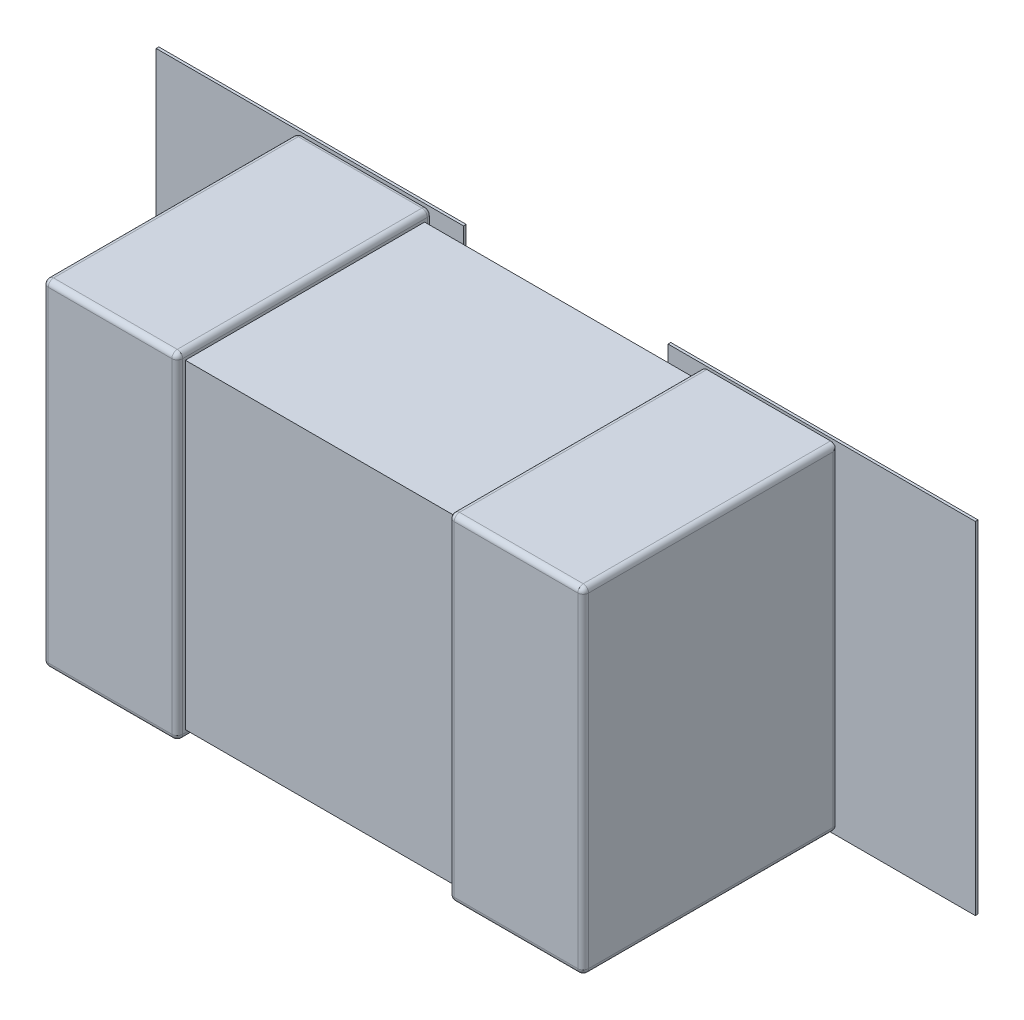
ISO-10303-21;
HEADER;
FILE_DESCRIPTION(('STEP AP214'),'2;1');
FILE_NAME('part.step','',(''),(''),'','','');
FILE_SCHEMA(('AUTOMOTIVE_DESIGN { 1 0 10303 214 1 1 1 1 }'));
ENDSEC;
DATA;
#1=APPLICATION_CONTEXT('core data for automotive mechanical design processes');
#2=APPLICATION_PROTOCOL_DEFINITION('international standard','automotive_design',2000,#1);
#3=PRODUCT_CONTEXT('',#1,'mechanical');
#4=PRODUCT('Part','Part','',(#3));
#5=PRODUCT_RELATED_PRODUCT_CATEGORY('part','',(#4));
#6=PRODUCT_DEFINITION_FORMATION('','',#4);
#7=PRODUCT_DEFINITION_CONTEXT('part definition',#1,'design');
#8=PRODUCT_DEFINITION('design','',#6,#7);
#9=PRODUCT_DEFINITION_SHAPE('','',#8);
#10=(LENGTH_UNIT() NAMED_UNIT(*) SI_UNIT(.MILLI.,.METRE.));
#11=(NAMED_UNIT(*) PLANE_ANGLE_UNIT() SI_UNIT($,.RADIAN.));
#12=(NAMED_UNIT(*) SI_UNIT($,.STERADIAN.) SOLID_ANGLE_UNIT());
#13=UNCERTAINTY_MEASURE_WITH_UNIT(LENGTH_MEASURE(1.E-05),#10,'distance_accuracy_value','');
#14=(GEOMETRIC_REPRESENTATION_CONTEXT(3) GLOBAL_UNCERTAINTY_ASSIGNED_CONTEXT((#13)) GLOBAL_UNIT_ASSIGNED_CONTEXT((#10,
#11,#12)) REPRESENTATION_CONTEXT('',''));
#15=CARTESIAN_POINT('',(0.,0.,0.));
#16=DIRECTION('',(0.,0.,1.));
#17=DIRECTION('',(1.,0.,0.));
#18=AXIS2_PLACEMENT_3D('',#15,#16,#17);
#19=CARTESIAN_POINT('',(0.98495100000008,-0.60496700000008,1.00616000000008));
#20=DIRECTION('',(0.707106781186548,0.,0.707106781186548));
#21=DIRECTION('',(0.,-1.,0.));
#22=AXIS2_PLACEMENT_3D('',#19,#20,#21);
#23=SPHERICAL_SURFACE('',#22,0.0199999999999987);
#24=CARTESIAN_POINT('',(0.98495100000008,-0.60496700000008,1.00616000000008));
#25=DIRECTION('',(1.,0.,0.));
#26=DIRECTION('',(0.,0.,-1.));
#27=AXIS2_PLACEMENT_3D('',#24,#25,#26);
#28=CIRCLE('',#27,0.0199999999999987);
#29=CARTESIAN_POINT('',(0.98495100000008,-0.624967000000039,1.00616000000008));
#30=VERTEX_POINT('',#29);
#31=CARTESIAN_POINT('',(0.98495100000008,-0.60496700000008,1.02616000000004));
#32=VERTEX_POINT('',#31);
#33=EDGE_CURVE('E392',#30,#32,#28,.F.);
#34=ORIENTED_EDGE('',*,*,#33,.F.);
#35=CARTESIAN_POINT('',(0.98495100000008,-0.60496700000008,1.00616000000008));
#36=DIRECTION('',(0.,0.,-1.));
#37=DIRECTION('',(-1.,0.,0.));
#38=AXIS2_PLACEMENT_3D('',#35,#36,#37);
#39=CIRCLE('',#38,0.0199999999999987);
#40=CARTESIAN_POINT('',(1.00495100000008,-0.60496700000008,1.00616000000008));
#41=VERTEX_POINT('',#40);
#42=EDGE_CURVE('E94',#41,#30,#39,.T.);
#43=ORIENTED_EDGE('',*,*,#42,.F.);
#44=CARTESIAN_POINT('',(0.98495100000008,-0.60496700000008,1.00616000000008));
#45=DIRECTION('',(0.,1.,0.));
#46=DIRECTION('',(0.,0.,1.));
#47=AXIS2_PLACEMENT_3D('',#44,#45,#46);
#48=CIRCLE('',#47,0.0199999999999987);
#49=CARTESIAN_POINT('',(0.99909313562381,-0.60496700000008,1.02030213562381));
#50=VERTEX_POINT('',#49);
#51=EDGE_CURVE('E54',#50,#41,#48,.T.);
#52=ORIENTED_EDGE('',*,*,#51,.F.);
#53=CARTESIAN_POINT('',(0.98495100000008,-0.60496700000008,1.00616000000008));
#54=DIRECTION('',(0.,1.,0.));
#55=DIRECTION('',(0.,0.,1.));
#56=AXIS2_PLACEMENT_3D('',#53,#54,#55);
#57=CIRCLE('',#56,0.0199999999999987);
#58=EDGE_CURVE('E35',#32,#50,#57,.T.);
#59=ORIENTED_EDGE('',*,*,#58,.F.);
#60=EDGE_LOOP('',(#34,#43,#52,#59));
#61=FACE_BOUND('',#60,.T.);
#62=ADVANCED_FACE('F16',(#61),#23,.T.);
#63=CARTESIAN_POINT('',(0.,0.,0.0762));
#64=DIRECTION('',(0.,0.,1.));
#65=DIRECTION('',(1.,0.,0.));
#66=AXIS2_PLACEMENT_3D('',#63,#64,#65);
#67=PLANE('',#66);
#68=DIRECTION('',(0.,1.,0.));
#69=VECTOR('',#68,1.);
#70=CARTESIAN_POINT('',(0.380500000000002,0.635,0.0762));
#71=LINE('',#70,#69);
#72=CARTESIAN_POINT('',(0.380500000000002,0.635,0.0762));
#73=VERTEX_POINT('',#72);
#74=CARTESIAN_POINT('',(0.380500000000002,-0.635,0.0762));
#75=VERTEX_POINT('',#74);
#76=EDGE_CURVE('E383',#73,#75,#71,.F.);
#77=ORIENTED_EDGE('',*,*,#76,.F.);
#78=DIRECTION('',(1.,0.,0.));
#79=VECTOR('',#78,1.);
#80=CARTESIAN_POINT('',(1.5235,0.635,0.0762));
#81=LINE('',#80,#79);
#82=CARTESIAN_POINT('',(1.5235,0.635,0.0762));
#83=VERTEX_POINT('',#82);
#84=EDGE_CURVE('E389',#83,#73,#81,.F.);
#85=ORIENTED_EDGE('',*,*,#84,.F.);
#86=DIRECTION('',(0.,1.,0.));
#87=VECTOR('',#86,1.);
#88=CARTESIAN_POINT('',(1.5235,-0.635,0.0762));
#89=LINE('',#88,#87);
#90=CARTESIAN_POINT('',(1.5235,-0.635,0.0762));
#91=VERTEX_POINT('',#90);
#92=EDGE_CURVE('E82',#91,#83,#89,.T.);
#93=ORIENTED_EDGE('',*,*,#92,.F.);
#94=DIRECTION('',(1.,0.,0.));
#95=VECTOR('',#94,1.);
#96=CARTESIAN_POINT('',(0.380500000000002,-0.635,0.0762));
#97=LINE('',#96,#95);
#98=EDGE_CURVE('E377',#75,#91,#97,.T.);
#99=ORIENTED_EDGE('',*,*,#98,.F.);
#100=EDGE_LOOP('',(#77,#85,#93,#99));
#101=FACE_BOUND('',#100,.T.);
#102=ADVANCED_FACE('F103',(#101),#67,.F.);
#103=CARTESIAN_POINT('',(0.98495100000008,0.60496700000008,1.00616000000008));
#104=DIRECTION('',(0.,0.707106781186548,0.707106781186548));
#105=DIRECTION('',(1.,0.,0.));
#106=AXIS2_PLACEMENT_3D('',#103,#104,#105);
#107=SPHERICAL_SURFACE('',#106,0.0199999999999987);
#108=CARTESIAN_POINT('',(0.98495100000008,0.60496700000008,1.00616000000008));
#109=DIRECTION('',(-1.,0.,0.));
#110=DIRECTION('',(0.,0.,1.));
#111=AXIS2_PLACEMENT_3D('',#108,#109,#110);
#112=CIRCLE('',#111,0.0199999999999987);
#113=CARTESIAN_POINT('',(0.98495100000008,0.61910913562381,1.02030213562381));
#114=VERTEX_POINT('',#113);
#115=CARTESIAN_POINT('',(0.98495100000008,0.624967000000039,1.00616000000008));
#116=VERTEX_POINT('',#115);
#117=EDGE_CURVE('E95',#114,#116,#112,.T.);
#118=ORIENTED_EDGE('',*,*,#117,.F.);
#119=CARTESIAN_POINT('',(0.98495100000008,0.60496700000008,1.00616000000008));
#120=DIRECTION('',(-1.,0.,0.));
#121=DIRECTION('',(0.,0.,1.));
#122=AXIS2_PLACEMENT_3D('',#119,#120,#121);
#123=CIRCLE('',#122,0.0199999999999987);
#124=CARTESIAN_POINT('',(0.98495100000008,0.60496700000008,1.02616000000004));
#125=VERTEX_POINT('',#124);
#126=EDGE_CURVE('E58',#125,#114,#123,.T.);
#127=ORIENTED_EDGE('',*,*,#126,.F.);
#128=CARTESIAN_POINT('',(0.98495100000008,0.60496700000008,1.00616000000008));
#129=DIRECTION('',(0.,1.,0.));
#130=DIRECTION('',(0.,0.,1.));
#131=AXIS2_PLACEMENT_3D('',#128,#129,#130);
#132=CIRCLE('',#131,0.0199999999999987);
#133=CARTESIAN_POINT('',(1.00495100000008,0.60496700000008,1.00616000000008));
#134=VERTEX_POINT('',#133);
#135=EDGE_CURVE('E20',#134,#125,#132,.F.);
#136=ORIENTED_EDGE('',*,*,#135,.F.);
#137=CARTESIAN_POINT('',(0.98495100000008,0.60496700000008,1.00616000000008));
#138=DIRECTION('',(0.,0.,-1.));
#139=DIRECTION('',(-1.,0.,0.));
#140=AXIS2_PLACEMENT_3D('',#137,#138,#139);
#141=CIRCLE('',#140,0.0199999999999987);
#142=EDGE_CURVE('E72',#116,#134,#141,.T.);
#143=ORIENTED_EDGE('',*,*,#142,.F.);
#144=EDGE_LOOP('',(#118,#127,#136,#143));
#145=FACE_BOUND('',#144,.T.);
#146=ADVANCED_FACE('F84',(#145),#107,.T.);
#147=CARTESIAN_POINT('',(1.004951,-0.624967,0.0762));
#148=DIRECTION('',(1.,0.,0.));
#149=DIRECTION('',(0.,0.,-1.));
#150=AXIS2_PLACEMENT_3D('',#147,#148,#149);
#151=PLANE('',#150);
#152=DIRECTION('',(0.,-1.,0.));
#153=VECTOR('',#152,1.);
#154=CARTESIAN_POINT('',(1.00495100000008,2.43846719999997,0.0961999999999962));
#155=LINE('',#154,#153);
#156=CARTESIAN_POINT('',(1.00495100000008,0.60496700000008,0.0961999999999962));
#157=VERTEX_POINT('',#156);
#158=CARTESIAN_POINT('',(1.00495100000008,-0.60496700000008,0.0961999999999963));
#159=VERTEX_POINT('',#158);
#160=EDGE_CURVE('E67',#157,#159,#155,.T.);
#161=ORIENTED_EDGE('',*,*,#160,.F.);
#162=DIRECTION('',(0.,0.,-1.));
#163=VECTOR('',#162,1.);
#164=CARTESIAN_POINT('',(1.00495100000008,0.60496700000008,2.264527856));
#165=LINE('',#164,#163);
#166=EDGE_CURVE('E62',#134,#157,#165,.T.);
#167=ORIENTED_EDGE('',*,*,#166,.F.);
#168=DIRECTION('',(0.,1.,0.));
#169=VECTOR('',#168,1.);
#170=CARTESIAN_POINT('',(1.00495100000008,-2.43846719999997,1.00616000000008));
#171=LINE('',#170,#169);
#172=EDGE_CURVE('E49',#41,#134,#171,.T.);
#173=ORIENTED_EDGE('',*,*,#172,.F.);
#174=DIRECTION('',(0.,0.,-1.));
#175=VECTOR('',#174,1.);
#176=CARTESIAN_POINT('',(1.00495100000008,-0.60496700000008,2.264527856));
#177=LINE('',#176,#175);
#178=EDGE_CURVE('E91',#159,#41,#177,.F.);
#179=ORIENTED_EDGE('',*,*,#178,.F.);
#180=EDGE_LOOP('',(#161,#167,#173,#179));
#181=FACE_BOUND('',#180,.T.);
#182=ADVANCED_FACE('F64',(#181),#151,.T.);
#183=CARTESIAN_POINT('',(0.98495100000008,-2.43846719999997,1.00616000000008));
#184=DIRECTION('',(0.,1.,0.));
#185=DIRECTION('',(0.,0.,1.));
#186=AXIS2_PLACEMENT_3D('',#183,#184,#185);
#187=CYLINDRICAL_SURFACE('',#186,0.0199999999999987);
#188=ORIENTED_EDGE('',*,*,#51,.T.);
#189=ORIENTED_EDGE('',*,*,#172,.T.);
#190=ORIENTED_EDGE('',*,*,#135,.T.);
#191=DIRECTION('',(0.,1.,0.));
#192=VECTOR('',#191,1.);
#193=CARTESIAN_POINT('',(0.98495100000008,0.,1.02616));
#194=LINE('',#193,#192);
#195=EDGE_CURVE('E89',#32,#125,#194,.T.);
#196=ORIENTED_EDGE('',*,*,#195,.F.);
#197=ORIENTED_EDGE('',*,*,#58,.T.);
#198=EDGE_LOOP('',(#188,#189,#190,#196,#197));
#199=FACE_BOUND('',#198,.T.);
#200=ADVANCED_FACE('F51',(#199),#187,.T.);
#201=CARTESIAN_POINT('',(5.4955692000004,0.60496700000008,1.00616000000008));
#202=DIRECTION('',(-1.,0.,0.));
#203=DIRECTION('',(0.,0.,1.));
#204=AXIS2_PLACEMENT_3D('',#201,#202,#203);
#205=CYLINDRICAL_SURFACE('',#204,0.0199999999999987);
#206=ORIENTED_EDGE('',*,*,#117,.T.);
#207=DIRECTION('',(1.,0.,0.));
#208=VECTOR('',#207,1.);
#209=CARTESIAN_POINT('',(1.004951,0.624967,1.00616000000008));
#210=LINE('',#209,#208);
#211=CARTESIAN_POINT('',(0.524950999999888,0.624967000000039,1.00616000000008));
#212=VERTEX_POINT('',#211);
#213=EDGE_CURVE('E415',#212,#116,#210,.T.);
#214=ORIENTED_EDGE('',*,*,#213,.F.);
#215=CARTESIAN_POINT('',(0.524950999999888,0.60496700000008,1.00616000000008));
#216=DIRECTION('',(-1.,0.,0.));
#217=DIRECTION('',(0.,0.,1.));
#218=AXIS2_PLACEMENT_3D('',#215,#216,#217);
#219=CIRCLE('',#218,0.0199999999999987);
#220=CARTESIAN_POINT('',(0.524950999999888,0.60496700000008,1.02616000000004));
#221=VERTEX_POINT('',#220);
#222=EDGE_CURVE('E416',#221,#212,#219,.T.);
#223=ORIENTED_EDGE('',*,*,#222,.F.);
#224=DIRECTION('',(1.,0.,0.));
#225=VECTOR('',#224,1.);
#226=CARTESIAN_POINT('',(0.,0.60496700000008,1.02616));
#227=LINE('',#226,#225);
#228=EDGE_CURVE('E420',#125,#221,#227,.F.);
#229=ORIENTED_EDGE('',*,*,#228,.F.);
#230=ORIENTED_EDGE('',*,*,#126,.T.);
#231=EDGE_LOOP('',(#206,#214,#223,#229,#230));
#232=FACE_BOUND('',#231,.T.);
#233=ADVANCED_FACE('F590',(#232),#205,.T.);
#234=CARTESIAN_POINT('',(0.98495100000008,-0.60496700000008,2.264527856));
#235=DIRECTION('',(0.,0.,-1.));
#236=DIRECTION('',(-1.,0.,0.));
#237=AXIS2_PLACEMENT_3D('',#234,#235,#236);
#238=CYLINDRICAL_SURFACE('',#237,0.0199999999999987);
#239=ORIENTED_EDGE('',*,*,#42,.T.);
#240=DIRECTION('',(0.,0.,-1.));
#241=VECTOR('',#240,1.);
#242=CARTESIAN_POINT('',(0.98495100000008,-0.624967,0.0762));
#243=LINE('',#242,#241);
#244=CARTESIAN_POINT('',(0.98495100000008,-0.624967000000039,0.096199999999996));
#245=VERTEX_POINT('',#244);
#246=EDGE_CURVE('E393',#245,#30,#243,.F.);
#247=ORIENTED_EDGE('',*,*,#246,.F.);
#248=CARTESIAN_POINT('',(0.98495100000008,-0.60496700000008,0.0961999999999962));
#249=DIRECTION('',(0.,0.,-1.));
#250=DIRECTION('',(0.707106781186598,-0.707106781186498,0.));
#251=AXIS2_PLACEMENT_3D('',#248,#249,#250);
#252=CIRCLE('',#251,0.0199999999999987);
#253=CARTESIAN_POINT('',(0.999093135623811,-0.619109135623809,0.0961999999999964));
#254=VERTEX_POINT('',#253);
#255=EDGE_CURVE('E364',#254,#245,#252,.T.);
#256=ORIENTED_EDGE('',*,*,#255,.F.);
#257=CARTESIAN_POINT('',(0.98495100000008,-0.60496700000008,0.0961999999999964));
#258=DIRECTION('',(0.,0.,-1.));
#259=DIRECTION('',(-1.,0.,0.));
#260=AXIS2_PLACEMENT_3D('',#257,#258,#259);
#261=CIRCLE('',#260,0.0199999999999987);
#262=EDGE_CURVE('E368',#159,#254,#261,.T.);
#263=ORIENTED_EDGE('',*,*,#262,.F.);
#264=ORIENTED_EDGE('',*,*,#178,.T.);
#265=EDGE_LOOP('',(#239,#247,#256,#263,#264));
#266=FACE_BOUND('',#265,.T.);
#267=ADVANCED_FACE('F638',(#266),#238,.T.);
#268=CARTESIAN_POINT('',(-5.4955692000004,-0.60496700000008,1.00616000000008));
#269=DIRECTION('',(1.,0.,0.));
#270=DIRECTION('',(0.,0.,-1.));
#271=AXIS2_PLACEMENT_3D('',#268,#269,#270);
#272=CYLINDRICAL_SURFACE('',#271,0.0199999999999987);
#273=ORIENTED_EDGE('',*,*,#33,.T.);
#274=DIRECTION('',(1.,0.,0.));
#275=VECTOR('',#274,1.);
#276=CARTESIAN_POINT('',(0.,-0.60496700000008,1.02616));
#277=LINE('',#276,#275);
#278=CARTESIAN_POINT('',(0.524950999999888,-0.60496700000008,1.02616000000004));
#279=VERTEX_POINT('',#278);
#280=EDGE_CURVE('E491',#279,#32,#277,.T.);
#281=ORIENTED_EDGE('',*,*,#280,.F.);
#282=CARTESIAN_POINT('',(0.524950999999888,-0.60496700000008,1.00616000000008));
#283=DIRECTION('',(1.,0.,0.));
#284=DIRECTION('',(0.,0.,-1.));
#285=AXIS2_PLACEMENT_3D('',#282,#283,#284);
#286=CIRCLE('',#285,0.0199999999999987);
#287=CARTESIAN_POINT('',(0.524950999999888,-0.624967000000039,1.00616000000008));
#288=VERTEX_POINT('',#287);
#289=EDGE_CURVE('E395',#288,#279,#286,.F.);
#290=ORIENTED_EDGE('',*,*,#289,.F.);
#291=DIRECTION('',(1.,0.,0.));
#292=VECTOR('',#291,1.);
#293=CARTESIAN_POINT('',(-1.004951,-0.624967,1.00616000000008));
#294=LINE('',#293,#292);
#295=EDGE_CURVE('E419',#30,#288,#294,.F.);
#296=ORIENTED_EDGE('',*,*,#295,.F.);
#297=EDGE_LOOP('',(#273,#281,#290,#296));
#298=FACE_BOUND('',#297,.T.);
#299=ADVANCED_FACE('F647',(#298),#272,.T.);
#300=CARTESIAN_POINT('',(1.5235,0.635,0.0762));
#301=DIRECTION('',(0.,1.,0.));
#302=DIRECTION('',(0.,0.,1.));
#303=AXIS2_PLACEMENT_3D('',#300,#301,#302);
#304=PLANE('',#303);
#305=DIRECTION('',(0.,0.,-1.));
#306=VECTOR('',#305,1.);
#307=CARTESIAN_POINT('',(1.5235,0.635,0.0762));
#308=LINE('',#307,#306);
#309=CARTESIAN_POINT('',(1.5235,0.635,0.0862000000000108));
#310=VERTEX_POINT('',#309);
#311=EDGE_CURVE('E374',#83,#310,#308,.F.);
#312=ORIENTED_EDGE('',*,*,#311,.F.);
#313=ORIENTED_EDGE('',*,*,#84,.T.);
#314=DIRECTION('',(0.,0.,1.));
#315=VECTOR('',#314,1.);
#316=CARTESIAN_POINT('',(0.380500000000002,0.635,0.0762));
#317=LINE('',#316,#315);
#318=CARTESIAN_POINT('',(0.380500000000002,0.635,0.0862000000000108));
#319=VERTEX_POINT('',#318);
#320=EDGE_CURVE('E386',#319,#73,#317,.F.);
#321=ORIENTED_EDGE('',*,*,#320,.F.);
#322=DIRECTION('',(1.,0.,0.));
#323=VECTOR('',#322,1.);
#324=CARTESIAN_POINT('',(0.,0.635,0.0862000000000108));
#325=LINE('',#324,#323);
#326=EDGE_CURVE('E424',#310,#319,#325,.F.);
#327=ORIENTED_EDGE('',*,*,#326,.F.);
#328=EDGE_LOOP('',(#312,#313,#321,#327));
#329=FACE_BOUND('',#328,.T.);
#330=ADVANCED_FACE('F1408',(#329),#304,.T.);
#331=CARTESIAN_POINT('',(0.380500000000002,0.635,0.0762));
#332=DIRECTION('',(-1.,0.,0.));
#333=DIRECTION('',(0.,0.,1.));
#334=AXIS2_PLACEMENT_3D('',#331,#332,#333);
#335=PLANE('',#334);
#336=ORIENTED_EDGE('',*,*,#320,.T.);
#337=ORIENTED_EDGE('',*,*,#76,.T.);
#338=DIRECTION('',(0.,0.,-1.));
#339=VECTOR('',#338,1.);
#340=CARTESIAN_POINT('',(0.380500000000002,-0.635,0.0762));
#341=LINE('',#340,#339);
#342=CARTESIAN_POINT('',(0.380500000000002,-0.635,0.0862000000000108));
#343=VERTEX_POINT('',#342);
#344=EDGE_CURVE('E380',#343,#75,#341,.T.);
#345=ORIENTED_EDGE('',*,*,#344,.F.);
#346=DIRECTION('',(0.,1.,0.));
#347=VECTOR('',#346,1.);
#348=CARTESIAN_POINT('',(0.380500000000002,0.,0.0862000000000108));
#349=LINE('',#348,#347);
#350=EDGE_CURVE('E432',#319,#343,#349,.F.);
#351=ORIENTED_EDGE('',*,*,#350,.F.);
#352=EDGE_LOOP('',(#336,#337,#345,#351));
#353=FACE_BOUND('',#352,.T.);
#354=ADVANCED_FACE('F1503',(#353),#335,.T.);
#355=CARTESIAN_POINT('',(0.380500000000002,-0.635,0.0762));
#356=DIRECTION('',(0.,-1.,0.));
#357=DIRECTION('',(0.,0.,-1.));
#358=AXIS2_PLACEMENT_3D('',#355,#356,#357);
#359=PLANE('',#358);
#360=ORIENTED_EDGE('',*,*,#344,.T.);
#361=ORIENTED_EDGE('',*,*,#98,.T.);
#362=DIRECTION('',(0.,0.,-1.));
#363=VECTOR('',#362,1.);
#364=CARTESIAN_POINT('',(1.5235,-0.635,0.0762));
#365=LINE('',#364,#363);
#366=CARTESIAN_POINT('',(1.5235,-0.635,0.0862000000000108));
#367=VERTEX_POINT('',#366);
#368=EDGE_CURVE('E371',#367,#91,#365,.T.);
#369=ORIENTED_EDGE('',*,*,#368,.F.);
#370=DIRECTION('',(1.,0.,0.));
#371=VECTOR('',#370,1.);
#372=CARTESIAN_POINT('',(0.,-0.635,0.0862000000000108));
#373=LINE('',#372,#371);
#374=EDGE_CURVE('E440',#343,#367,#373,.T.);
#375=ORIENTED_EDGE('',*,*,#374,.F.);
#376=EDGE_LOOP('',(#360,#361,#369,#375));
#377=FACE_BOUND('',#376,.T.);
#378=ADVANCED_FACE('F1496',(#377),#359,.T.);
#379=CARTESIAN_POINT('',(1.5235,-0.635,0.0762));
#380=DIRECTION('',(1.,0.,0.));
#381=DIRECTION('',(0.,0.,-1.));
#382=AXIS2_PLACEMENT_3D('',#379,#380,#381);
#383=PLANE('',#382);
#384=ORIENTED_EDGE('',*,*,#368,.T.);
#385=ORIENTED_EDGE('',*,*,#92,.T.);
#386=ORIENTED_EDGE('',*,*,#311,.T.);
#387=DIRECTION('',(0.,1.,0.));
#388=VECTOR('',#387,1.);
#389=CARTESIAN_POINT('',(1.5235,0.,0.0862000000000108));
#390=LINE('',#389,#388);
#391=EDGE_CURVE('E518',#367,#310,#390,.T.);
#392=ORIENTED_EDGE('',*,*,#391,.F.);
#393=EDGE_LOOP('',(#384,#385,#386,#392));
#394=FACE_BOUND('',#393,.T.);
#395=ADVANCED_FACE('F1397',(#394),#383,.T.);
#396=CARTESIAN_POINT('',(0.98495100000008,0.60496700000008,2.264527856));
#397=DIRECTION('',(0.,0.,-1.));
#398=DIRECTION('',(-1.,0.,0.));
#399=AXIS2_PLACEMENT_3D('',#396,#397,#398);
#400=CYLINDRICAL_SURFACE('',#399,0.0199999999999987);
#401=CARTESIAN_POINT('',(0.98495100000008,0.60496700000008,0.0961999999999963));
#402=DIRECTION('',(0.,-0.707106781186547,-0.707106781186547));
#403=DIRECTION('',(0.,-0.707106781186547,0.707106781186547));
#404=AXIS2_PLACEMENT_3D('',#401,#402,#403);
#405=ELLIPSE('',#404,0.0282842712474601,0.0199999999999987);
#406=CARTESIAN_POINT('',(1.00227150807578,0.614967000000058,0.0862000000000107));
#407=VERTEX_POINT('',#406);
#408=EDGE_CURVE('E71',#407,#157,#405,.T.);
#409=ORIENTED_EDGE('',*,*,#408,.F.);
#410=CARTESIAN_POINT('',(0.98495100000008,0.60496700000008,0.0862000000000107));
#411=DIRECTION('',(0.,0.,-1.));
#412=DIRECTION('',(-1.,0.,0.));
#413=AXIS2_PLACEMENT_3D('',#410,#411,#412);
#414=CIRCLE('',#413,0.0199999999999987);
#415=CARTESIAN_POINT('',(0.98495100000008,0.624967,0.0862000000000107));
#416=VERTEX_POINT('',#415);
#417=EDGE_CURVE('E347',#416,#407,#414,.T.);
#418=ORIENTED_EDGE('',*,*,#417,.F.);
#419=DIRECTION('',(0.,0.,1.));
#420=VECTOR('',#419,1.);
#421=CARTESIAN_POINT('',(0.98495100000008,0.624967,0.0762));
#422=LINE('',#421,#420);
#423=EDGE_CURVE('E79',#116,#416,#422,.F.);
#424=ORIENTED_EDGE('',*,*,#423,.F.);
#425=ORIENTED_EDGE('',*,*,#142,.T.);
#426=ORIENTED_EDGE('',*,*,#166,.T.);
#427=EDGE_LOOP('',(#409,#418,#424,#425,#426));
#428=FACE_BOUND('',#427,.T.);
#429=ADVANCED_FACE('F76',(#428),#400,.T.);
#430=CARTESIAN_POINT('',(0.98495100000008,2.43846719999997,0.0961999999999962));
#431=DIRECTION('',(0.,-1.,0.));
#432=DIRECTION('',(0.,0.,-1.));
#433=AXIS2_PLACEMENT_3D('',#430,#431,#432);
#434=CYLINDRICAL_SURFACE('',#433,0.0199999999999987);
#435=CARTESIAN_POINT('',(0.98495100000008,-0.60496700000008,0.0961999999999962));
#436=DIRECTION('',(0.,-1.,0.));
#437=DIRECTION('',(0.,0.,-1.));
#438=AXIS2_PLACEMENT_3D('',#435,#436,#437);
#439=CIRCLE('',#438,0.0199999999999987);
#440=CARTESIAN_POINT('',(1.00227150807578,-0.60496700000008,0.0862000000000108));
#441=VERTEX_POINT('',#440);
#442=EDGE_CURVE('E96',#441,#159,#439,.T.);
#443=ORIENTED_EDGE('',*,*,#442,.F.);
#444=DIRECTION('',(0.,1.,0.));
#445=VECTOR('',#444,1.);
#446=CARTESIAN_POINT('',(1.00227150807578,0.,0.0862000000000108));
#447=LINE('',#446,#445);
#448=EDGE_CURVE('E346',#407,#441,#447,.F.);
#449=ORIENTED_EDGE('',*,*,#448,.F.);
#450=ORIENTED_EDGE('',*,*,#408,.T.);
#451=ORIENTED_EDGE('',*,*,#160,.T.);
#452=EDGE_LOOP('',(#443,#449,#450,#451));
#453=FACE_BOUND('',#452,.T.);
#454=ADVANCED_FACE('F356',(#453),#434,.T.);
#455=CARTESIAN_POINT('',(0.98495100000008,-0.60496700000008,0.0961999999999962));
#456=DIRECTION('',(0.707106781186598,-0.707106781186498,0.));
#457=DIRECTION('',(0.,0.,-1.));
#458=AXIS2_PLACEMENT_3D('',#455,#456,#457);
#459=SPHERICAL_SURFACE('',#458,0.0199999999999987);
#460=CARTESIAN_POINT('',(0.98495100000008,-0.60496700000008,0.0961999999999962));
#461=DIRECTION('',(-1.,0.,0.));
#462=DIRECTION('',(0.,0.,1.));
#463=AXIS2_PLACEMENT_3D('',#460,#461,#462);
#464=CIRCLE('',#463,0.0199999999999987);
#465=CARTESIAN_POINT('',(0.98495100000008,-0.62228750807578,0.0862000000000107));
#466=VERTEX_POINT('',#465);
#467=EDGE_CURVE('E367',#466,#245,#464,.T.);
#468=ORIENTED_EDGE('',*,*,#467,.F.);
#469=CARTESIAN_POINT('',(1.00227150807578,-0.60496700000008,0.0862000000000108));
#470=CARTESIAN_POINT('',(1.00228438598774,-0.60691927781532,0.0862000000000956));
#471=CARTESIAN_POINT('',(1.00194331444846,-0.608863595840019,0.0862000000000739));
#472=CARTESIAN_POINT('',(1.00064694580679,-0.612536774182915,0.0862000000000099));
#473=CARTESIAN_POINT('',(0.999691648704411,-0.614265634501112,0.0861999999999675));
#474=CARTESIAN_POINT('',(0.99726050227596,-0.617308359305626,0.0862000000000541));
#475=CARTESIAN_POINT('',(0.995784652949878,-0.618622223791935,0.086200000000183));
#476=CARTESIAN_POINT('',(0.992479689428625,-0.620685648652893,0.0862000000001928));
#477=CARTESIAN_POINT('',(0.990650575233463,-0.621435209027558,0.0862000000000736));
#478=CARTESIAN_POINT('',(0.987505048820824,-0.622147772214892,0.0861999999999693));
#479=CARTESIAN_POINT('',(0.986227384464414,-0.622292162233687,0.0861999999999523));
#480=CARTESIAN_POINT('',(0.98495100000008,-0.622287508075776,0.0862000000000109));
#481=B_SPLINE_CURVE_WITH_KNOTS('',3,(#469,#470,#471,#472,#473,#474,#475,#476,#477,#478,#479,
#480),.UNSPECIFIED.,.F.,.F.,(4,2,2,2,2,4),(0.,0.00581573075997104,0.0116314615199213,
0.0174471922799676,0.0232629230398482,0.0270884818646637),.UNSPECIFIED.);
#482=EDGE_CURVE('E338',#441,#466,#481,.T.);
#483=ORIENTED_EDGE('',*,*,#482,.F.);
#484=ORIENTED_EDGE('',*,*,#442,.T.);
#485=ORIENTED_EDGE('',*,*,#262,.T.);
#486=ORIENTED_EDGE('',*,*,#255,.T.);
#487=EDGE_LOOP('',(#468,#483,#484,#485,#486));
#488=FACE_BOUND('',#487,.T.);
#489=ADVANCED_FACE('F349',(#488),#459,.T.);
#490=CARTESIAN_POINT('',(5.4955692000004,-0.60496700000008,0.0961999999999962));
#491=DIRECTION('',(-1.,0.,0.));
#492=DIRECTION('',(0.,0.,1.));
#493=AXIS2_PLACEMENT_3D('',#490,#491,#492);
#494=CYLINDRICAL_SURFACE('',#493,0.0199999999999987);
#495=CARTESIAN_POINT('',(0.524950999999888,-0.60496700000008,0.0961999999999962));
#496=DIRECTION('',(-1.,0.,0.));
#497=DIRECTION('',(0.,0.,1.));
#498=AXIS2_PLACEMENT_3D('',#495,#496,#497);
#499=CIRCLE('',#498,0.0199999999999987);
#500=CARTESIAN_POINT('',(0.524950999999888,-0.62228750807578,0.0862000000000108));
#501=VERTEX_POINT('',#500);
#502=CARTESIAN_POINT('',(0.524950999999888,-0.624967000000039,0.0961999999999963));
#503=VERTEX_POINT('',#502);
#504=EDGE_CURVE('E422',#501,#503,#499,.T.);
#505=ORIENTED_EDGE('',*,*,#504,.F.);
#506=DIRECTION('',(1.,0.,0.));
#507=VECTOR('',#506,1.);
#508=CARTESIAN_POINT('',(0.,-0.622287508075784,0.0862000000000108));
#509=LINE('',#508,#507);
#510=EDGE_CURVE('E345',#466,#501,#509,.F.);
#511=ORIENTED_EDGE('',*,*,#510,.F.);
#512=ORIENTED_EDGE('',*,*,#467,.T.);
#513=DIRECTION('',(1.,0.,0.));
#514=VECTOR('',#513,1.);
#515=CARTESIAN_POINT('',(-1.004951,-0.624967,0.0961999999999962));
#516=LINE('',#515,#514);
#517=EDGE_CURVE('E396',#503,#245,#516,.T.);
#518=ORIENTED_EDGE('',*,*,#517,.F.);
#519=EDGE_LOOP('',(#505,#511,#512,#518));
#520=FACE_BOUND('',#519,.T.);
#521=ADVANCED_FACE('F355',(#520),#494,.T.);
#522=CARTESIAN_POINT('',(1.004951,0.624967,0.0762));
#523=DIRECTION('',(0.,1.,0.));
#524=DIRECTION('',(0.,0.,1.));
#525=AXIS2_PLACEMENT_3D('',#522,#523,#524);
#526=PLANE('',#525);
#527=ORIENTED_EDGE('',*,*,#423,.T.);
#528=DIRECTION('',(1.,0.,0.));
#529=VECTOR('',#528,1.);
#530=CARTESIAN_POINT('',(0.,0.624967,0.0862000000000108));
#531=LINE('',#530,#529);
#532=CARTESIAN_POINT('',(0.524950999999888,0.624967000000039,0.0862000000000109));
#533=VERTEX_POINT('',#532);
#534=EDGE_CURVE('E507',#533,#416,#531,.T.);
#535=ORIENTED_EDGE('',*,*,#534,.F.);
#536=DIRECTION('',(0.,0.,1.));
#537=VECTOR('',#536,1.);
#538=CARTESIAN_POINT('',(0.524950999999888,0.624967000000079,-1.162167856));
#539=LINE('',#538,#537);
#540=EDGE_CURVE('E496',#212,#533,#539,.F.);
#541=ORIENTED_EDGE('',*,*,#540,.F.);
#542=ORIENTED_EDGE('',*,*,#213,.T.);
#543=EDGE_LOOP('',(#527,#535,#541,#542));
#544=FACE_BOUND('',#543,.T.);
#545=ADVANCED_FACE('F505',(#544),#526,.T.);
#546=CARTESIAN_POINT('',(0.,0.,1.02616));
#547=DIRECTION('',(0.,0.,1.));
#548=DIRECTION('',(1.,0.,0.));
#549=AXIS2_PLACEMENT_3D('',#546,#547,#548);
#550=PLANE('',#549);
#551=ORIENTED_EDGE('',*,*,#195,.T.);
#552=ORIENTED_EDGE('',*,*,#228,.T.);
#553=DIRECTION('',(0.,-1.,0.));
#554=VECTOR('',#553,1.);
#555=CARTESIAN_POINT('',(0.524950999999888,2.43846719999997,1.02616000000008));
#556=LINE('',#555,#554);
#557=EDGE_CURVE('E489',#279,#221,#556,.F.);
#558=ORIENTED_EDGE('',*,*,#557,.F.);
#559=ORIENTED_EDGE('',*,*,#280,.T.);
#560=EDGE_LOOP('',(#551,#552,#558,#559));
#561=FACE_BOUND('',#560,.T.);
#562=ADVANCED_FACE('F484',(#561),#550,.T.);
#563=CARTESIAN_POINT('',(0.524950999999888,0.60496700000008,1.00616000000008));
#564=DIRECTION('',(-0.707106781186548,0.,0.707106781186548));
#565=DIRECTION('',(0.,1.,0.));
#566=AXIS2_PLACEMENT_3D('',#563,#564,#565);
#567=SPHERICAL_SURFACE('',#566,0.0199999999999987);
#568=ORIENTED_EDGE('',*,*,#222,.T.);
#569=CARTESIAN_POINT('',(0.524950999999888,0.60496700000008,1.00616000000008));
#570=DIRECTION('',(0.,0.,1.));
#571=DIRECTION('',(1.,0.,0.));
#572=AXIS2_PLACEMENT_3D('',#569,#570,#571);
#573=CIRCLE('',#572,0.0199999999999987);
#574=CARTESIAN_POINT('',(0.504950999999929,0.60496700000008,1.00616000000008));
#575=VERTEX_POINT('',#574);
#576=EDGE_CURVE('E499',#575,#212,#573,.F.);
#577=ORIENTED_EDGE('',*,*,#576,.F.);
#578=CARTESIAN_POINT('',(0.524950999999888,0.60496700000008,1.00616000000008));
#579=DIRECTION('',(0.,-1.,0.));
#580=DIRECTION('',(0.,0.,-1.));
#581=AXIS2_PLACEMENT_3D('',#578,#579,#580);
#582=CIRCLE('',#581,0.0199999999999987);
#583=CARTESIAN_POINT('',(0.510808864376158,0.60496700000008,1.02030213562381));
#584=VERTEX_POINT('',#583);
#585=EDGE_CURVE('E530',#584,#575,#582,.T.);
#586=ORIENTED_EDGE('',*,*,#585,.F.);
#587=CARTESIAN_POINT('',(0.524950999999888,0.60496700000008,1.00616000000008));
#588=DIRECTION('',(0.,-1.,0.));
#589=DIRECTION('',(0.,0.,-1.));
#590=AXIS2_PLACEMENT_3D('',#587,#588,#589);
#591=CIRCLE('',#590,0.0199999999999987);
#592=EDGE_CURVE('E527',#221,#584,#591,.T.);
#593=ORIENTED_EDGE('',*,*,#592,.F.);
#594=EDGE_LOOP('',(#568,#577,#586,#593));
#595=FACE_BOUND('',#594,.T.);
#596=ADVANCED_FACE('F479',(#595),#567,.T.);
#597=CARTESIAN_POINT('',(-1.004951,-0.624967,0.0762));
#598=DIRECTION('',(0.,-1.,0.));
#599=DIRECTION('',(0.,0.,-1.));
#600=AXIS2_PLACEMENT_3D('',#597,#598,#599);
#601=PLANE('',#600);
#602=ORIENTED_EDGE('',*,*,#517,.T.);
#603=ORIENTED_EDGE('',*,*,#246,.T.);
#604=ORIENTED_EDGE('',*,*,#295,.T.);
#605=DIRECTION('',(0.,0.,-1.));
#606=VECTOR('',#605,1.);
#607=CARTESIAN_POINT('',(0.524950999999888,-0.624967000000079,2.264527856));
#608=LINE('',#607,#606);
#609=EDGE_CURVE('E464',#503,#288,#608,.F.);
#610=ORIENTED_EDGE('',*,*,#609,.F.);
#611=EDGE_LOOP('',(#602,#603,#604,#610));
#612=FACE_BOUND('',#611,.T.);
#613=ADVANCED_FACE('F475',(#612),#601,.T.);
#614=CARTESIAN_POINT('',(0.524950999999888,-0.60496700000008,1.00616000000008));
#615=DIRECTION('',(-0.707106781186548,-0.707106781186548,0.));
#616=DIRECTION('',(0.,0.,1.));
#617=AXIS2_PLACEMENT_3D('',#614,#615,#616);
#618=SPHERICAL_SURFACE('',#617,0.0199999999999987);
#619=ORIENTED_EDGE('',*,*,#289,.T.);
#620=CARTESIAN_POINT('',(0.524950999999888,-0.60496700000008,1.00616000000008));
#621=DIRECTION('',(0.,-1.,0.));
#622=DIRECTION('',(0.,0.,-1.));
#623=AXIS2_PLACEMENT_3D('',#620,#621,#622);
#624=CIRCLE('',#623,0.0199999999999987);
#625=CARTESIAN_POINT('',(0.504950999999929,-0.60496700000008,1.00616000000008));
#626=VERTEX_POINT('',#625);
#627=EDGE_CURVE('E468',#626,#279,#624,.F.);
#628=ORIENTED_EDGE('',*,*,#627,.F.);
#629=CARTESIAN_POINT('',(0.524950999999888,-0.60496700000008,1.00616000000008));
#630=DIRECTION('',(0.,0.,-1.));
#631=DIRECTION('',(-1.,0.,0.));
#632=AXIS2_PLACEMENT_3D('',#629,#630,#631);
#633=CIRCLE('',#632,0.0199999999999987);
#634=CARTESIAN_POINT('',(0.510808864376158,-0.61910913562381,1.00616000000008));
#635=VERTEX_POINT('',#634);
#636=EDGE_CURVE('E533',#635,#626,#633,.T.);
#637=ORIENTED_EDGE('',*,*,#636,.F.);
#638=CARTESIAN_POINT('',(0.524950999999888,-0.60496700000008,1.00616000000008));
#639=DIRECTION('',(0.,0.,-1.));
#640=DIRECTION('',(-1.,0.,0.));
#641=AXIS2_PLACEMENT_3D('',#638,#639,#640);
#642=CIRCLE('',#641,0.0199999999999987);
#643=EDGE_CURVE('E467',#288,#635,#642,.T.);
#644=ORIENTED_EDGE('',*,*,#643,.F.);
#645=EDGE_LOOP('',(#619,#628,#637,#644));
#646=FACE_BOUND('',#645,.T.);
#647=ADVANCED_FACE('F472',(#646),#618,.T.);
#648=CARTESIAN_POINT('',(0.524950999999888,-0.60496700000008,0.0961999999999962));
#649=DIRECTION('',(-0.707106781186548,0.,-0.707106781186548));
#650=DIRECTION('',(0.,-1.,0.));
#651=AXIS2_PLACEMENT_3D('',#648,#649,#650);
#652=SPHERICAL_SURFACE('',#651,0.0199999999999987);
#653=CARTESIAN_POINT('',(0.524950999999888,-0.60496700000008,0.0961999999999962));
#654=DIRECTION('',(0.,1.,0.));
#655=DIRECTION('',(0.,0.,1.));
#656=AXIS2_PLACEMENT_3D('',#653,#654,#655);
#657=CIRCLE('',#656,0.0199999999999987);
#658=CARTESIAN_POINT('',(0.507630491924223,-0.60496700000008,0.0861999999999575));
#659=VERTEX_POINT('',#658);
#660=CARTESIAN_POINT('',(0.504950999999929,-0.60496700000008,0.0961999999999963));
#661=VERTEX_POINT('',#660);
#662=EDGE_CURVE('E449',#659,#661,#657,.T.);
#663=ORIENTED_EDGE('',*,*,#662,.F.);
#664=CARTESIAN_POINT('',(0.524950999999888,-0.622287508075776,0.0862000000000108));
#665=CARTESIAN_POINT('',(0.522998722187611,-0.622300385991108,0.0862000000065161));
#666=CARTESIAN_POINT('',(0.521054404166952,-0.621959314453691,0.0862000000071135));
#667=CARTESIAN_POINT('',(0.517381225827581,-0.620662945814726,0.0862000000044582));
#668=CARTESIAN_POINT('',(0.515652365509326,-0.619707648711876,0.0862000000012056));
#669=CARTESIAN_POINT('',(0.512609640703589,-0.617276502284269,0.086199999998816));
#670=CARTESIAN_POINT('',(0.511295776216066,-0.615800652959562,0.0861999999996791));
#671=CARTESIAN_POINT('',(0.509232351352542,-0.612495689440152,0.0862000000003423));
#672=CARTESIAN_POINT('',(0.508482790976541,-0.610666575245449,0.0862000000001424));
#673=CARTESIAN_POINT('',(0.507770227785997,-0.607521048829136,0.0861999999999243));
#674=CARTESIAN_POINT('',(0.507625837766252,-0.606243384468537,0.0861999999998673));
#675=CARTESIAN_POINT('',(0.507630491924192,-0.60496700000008,0.0862000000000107));
#676=B_SPLINE_CURVE_WITH_KNOTS('',3,(#664,#665,#666,#667,#668,#669,#670,#671,#672,#673,#674,
#675),.UNSPECIFIED.,.F.,.F.,(4,2,2,2,2,4),(0.,0.00581573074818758,0.0116314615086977,
0.0174471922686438,0.0232629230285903,0.027088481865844),.UNSPECIFIED.);
#677=EDGE_CURVE('E332',#501,#659,#676,.T.);
#678=ORIENTED_EDGE('',*,*,#677,.F.);
#679=ORIENTED_EDGE('',*,*,#504,.T.);
#680=CARTESIAN_POINT('',(0.524950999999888,-0.60496700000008,0.0961999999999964));
#681=DIRECTION('',(0.,0.,-1.));
#682=DIRECTION('',(-1.,0.,0.));
#683=AXIS2_PLACEMENT_3D('',#680,#681,#682);
#684=CIRCLE('',#683,0.0199999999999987);
#685=EDGE_CURVE('E452',#661,#503,#684,.F.);
#686=ORIENTED_EDGE('',*,*,#685,.F.);
#687=EDGE_LOOP('',(#663,#678,#679,#686));
#688=FACE_BOUND('',#687,.T.);
#689=ADVANCED_FACE('F325',(#688),#652,.T.);
#690=CARTESIAN_POINT('',(0.,0.,0.0862000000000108));
#691=DIRECTION('',(0.,0.,1.));
#692=DIRECTION('',(1.,0.,0.));
#693=AXIS2_PLACEMENT_3D('',#690,#691,#692);
#694=PLANE('',#693);
#695=CARTESIAN_POINT('',(0.524950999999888,0.60496700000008,0.0862000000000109));
#696=DIRECTION('',(0.,0.,1.));
#697=DIRECTION('',(1.,0.,0.));
#698=AXIS2_PLACEMENT_3D('',#695,#696,#697);
#699=CIRCLE('',#698,0.0199999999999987);
#700=CARTESIAN_POINT('',(0.507630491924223,0.614967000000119,0.0861999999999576));
#701=VERTEX_POINT('',#700);
#702=EDGE_CURVE('E498',#533,#701,#699,.T.);
#703=ORIENTED_EDGE('',*,*,#702,.F.);
#704=ORIENTED_EDGE('',*,*,#534,.T.);
#705=ORIENTED_EDGE('',*,*,#417,.T.);
#706=ORIENTED_EDGE('',*,*,#448,.T.);
#707=ORIENTED_EDGE('',*,*,#482,.T.);
#708=ORIENTED_EDGE('',*,*,#510,.T.);
#709=ORIENTED_EDGE('',*,*,#677,.T.);
#710=DIRECTION('',(0.,1.,0.));
#711=VECTOR('',#710,1.);
#712=CARTESIAN_POINT('',(0.507630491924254,-2.43846719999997,0.0861999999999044));
#713=LINE('',#712,#711);
#714=EDGE_CURVE('E444',#701,#659,#713,.F.);
#715=ORIENTED_EDGE('',*,*,#714,.F.);
#716=EDGE_LOOP('',(#703,#704,#705,#706,#707,#708,#709,#715));
#717=FACE_BOUND('',#716,.T.);
#718=ORIENTED_EDGE('',*,*,#374,.T.);
#719=ORIENTED_EDGE('',*,*,#391,.T.);
#720=ORIENTED_EDGE('',*,*,#326,.T.);
#721=ORIENTED_EDGE('',*,*,#350,.T.);
#722=EDGE_LOOP('',(#718,#719,#720,#721));
#723=FACE_BOUND('',#722,.T.);
#724=ADVANCED_FACE('F320',(#717,#723),#694,.T.);
#725=CARTESIAN_POINT('',(0.524950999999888,0.60496700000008,-1.162167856));
#726=DIRECTION('',(0.,0.,1.));
#727=DIRECTION('',(1.,0.,0.));
#728=AXIS2_PLACEMENT_3D('',#725,#726,#727);
#729=CYLINDRICAL_SURFACE('',#728,0.0199999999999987);
#730=ORIENTED_EDGE('',*,*,#540,.T.);
#731=ORIENTED_EDGE('',*,*,#702,.T.);
#732=CARTESIAN_POINT('',(0.524950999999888,0.60496700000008,0.0961999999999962));
#733=DIRECTION('',(0.,0.707106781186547,0.707106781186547));
#734=DIRECTION('',(0.,0.707106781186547,-0.707106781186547));
#735=AXIS2_PLACEMENT_3D('',#732,#733,#734);
#736=ELLIPSE('',#735,0.0282842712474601,0.0199999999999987);
#737=CARTESIAN_POINT('',(0.504950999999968,0.60496700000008,0.0961999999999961));
#738=VERTEX_POINT('',#737);
#739=EDGE_CURVE('E448',#738,#701,#736,.F.);
#740=ORIENTED_EDGE('',*,*,#739,.F.);
#741=DIRECTION('',(0.,0.,-1.));
#742=VECTOR('',#741,1.);
#743=CARTESIAN_POINT('',(0.504950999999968,0.60496700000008,0.106200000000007));
#744=LINE('',#743,#742);
#745=EDGE_CURVE('E447',#738,#575,#744,.F.);
#746=ORIENTED_EDGE('',*,*,#745,.T.);
#747=ORIENTED_EDGE('',*,*,#576,.T.);
#748=EDGE_LOOP('',(#730,#731,#740,#746,#747));
#749=FACE_BOUND('',#748,.T.);
#750=ADVANCED_FACE('F316',(#749),#729,.T.);
#751=CARTESIAN_POINT('',(0.524950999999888,2.43846719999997,1.00616000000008));
#752=DIRECTION('',(0.,-1.,0.));
#753=DIRECTION('',(0.,0.,-1.));
#754=AXIS2_PLACEMENT_3D('',#751,#752,#753);
#755=CYLINDRICAL_SURFACE('',#754,0.0199999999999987);
#756=DIRECTION('',(0.,1.,0.));
#757=VECTOR('',#756,1.);
#758=CARTESIAN_POINT('',(0.504950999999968,-0.624967,1.00616000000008));
#759=LINE('',#758,#757);
#760=EDGE_CURVE('E455',#575,#626,#759,.F.);
#761=ORIENTED_EDGE('',*,*,#760,.T.);
#762=ORIENTED_EDGE('',*,*,#627,.T.);
#763=ORIENTED_EDGE('',*,*,#557,.T.);
#764=ORIENTED_EDGE('',*,*,#592,.T.);
#765=ORIENTED_EDGE('',*,*,#585,.T.);
#766=EDGE_LOOP('',(#761,#762,#763,#764,#765));
#767=FACE_BOUND('',#766,.T.);
#768=ADVANCED_FACE('F312',(#767),#755,.T.);
#769=CARTESIAN_POINT('',(0.524950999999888,-0.60496700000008,2.264527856));
#770=DIRECTION('',(0.,0.,-1.));
#771=DIRECTION('',(-1.,0.,0.));
#772=AXIS2_PLACEMENT_3D('',#769,#770,#771);
#773=CYLINDRICAL_SURFACE('',#772,0.0199999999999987);
#774=DIRECTION('',(0.,0.,-1.));
#775=VECTOR('',#774,1.);
#776=CARTESIAN_POINT('',(0.504950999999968,-0.60496700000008,0.106200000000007));
#777=LINE('',#776,#775);
#778=EDGE_CURVE('E459',#626,#661,#777,.T.);
#779=ORIENTED_EDGE('',*,*,#778,.T.);
#780=ORIENTED_EDGE('',*,*,#685,.T.);
#781=ORIENTED_EDGE('',*,*,#609,.T.);
#782=ORIENTED_EDGE('',*,*,#643,.T.);
#783=ORIENTED_EDGE('',*,*,#636,.T.);
#784=EDGE_LOOP('',(#779,#780,#781,#782,#783));
#785=FACE_BOUND('',#784,.T.);
#786=ADVANCED_FACE('F308',(#785),#773,.T.);
#787=CARTESIAN_POINT('',(0.524950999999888,-2.43846719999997,0.0961999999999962));
#788=DIRECTION('',(0.,1.,0.));
#789=DIRECTION('',(0.,0.,1.));
#790=AXIS2_PLACEMENT_3D('',#787,#788,#789);
#791=CYLINDRICAL_SURFACE('',#790,0.0199999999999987);
#792=ORIENTED_EDGE('',*,*,#739,.T.);
#793=ORIENTED_EDGE('',*,*,#714,.T.);
#794=ORIENTED_EDGE('',*,*,#662,.T.);
#795=DIRECTION('',(0.,1.,0.));
#796=VECTOR('',#795,1.);
#797=CARTESIAN_POINT('',(0.504950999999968,-0.624967,0.0961999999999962));
#798=LINE('',#797,#796);
#799=EDGE_CURVE('E456',#661,#738,#798,.T.);
#800=ORIENTED_EDGE('',*,*,#799,.T.);
#801=EDGE_LOOP('',(#792,#793,#794,#800));
#802=FACE_BOUND('',#801,.T.);
#803=ADVANCED_FACE('F304',(#802),#791,.T.);
#804=CARTESIAN_POINT('',(0.,0.,1.02616));
#805=DIRECTION('',(0.,0.,1.));
#806=DIRECTION('',(1.,0.,0.));
#807=AXIS2_PLACEMENT_3D('',#804,#805,#806);
#808=PLANE('',#807);
#809=DIRECTION('',(0.,-1.,0.));
#810=VECTOR('',#809,1.);
#811=CARTESIAN_POINT('',(-0.98495100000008,2.43846719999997,1.02616000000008));
#812=LINE('',#811,#810);
#813=CARTESIAN_POINT('',(-0.98495100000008,-0.60496700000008,1.02616000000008));
#814=VERTEX_POINT('',#813);
#815=CARTESIAN_POINT('',(-0.98495100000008,0.604967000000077,1.02616000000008));
#816=VERTEX_POINT('',#815);
#817=EDGE_CURVE('E538',#814,#816,#812,.F.);
#818=ORIENTED_EDGE('',*,*,#817,.F.);
#819=DIRECTION('',(1.,0.,0.));
#820=VECTOR('',#819,1.);
#821=CARTESIAN_POINT('',(-5.4955692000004,-0.60496700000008,1.02616000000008));
#822=LINE('',#821,#820);
#823=CARTESIAN_POINT('',(-0.524950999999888,-0.60496700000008,1.02616000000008));
#824=VERTEX_POINT('',#823);
#825=EDGE_CURVE('E534',#824,#814,#822,.F.);
#826=ORIENTED_EDGE('',*,*,#825,.F.);
#827=DIRECTION('',(0.,1.,0.));
#828=VECTOR('',#827,1.);
#829=CARTESIAN_POINT('',(-0.524950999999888,-2.43846719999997,1.02616000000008));
#830=LINE('',#829,#828);
#831=CARTESIAN_POINT('',(-0.524950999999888,0.60496700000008,1.02616000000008));
#832=VERTEX_POINT('',#831);
#833=EDGE_CURVE('E291',#832,#824,#830,.F.);
#834=ORIENTED_EDGE('',*,*,#833,.F.);
#835=DIRECTION('',(-1.,0.,0.));
#836=VECTOR('',#835,1.);
#837=CARTESIAN_POINT('',(5.4955692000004,0.60496700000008,1.02616000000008));
#838=LINE('',#837,#836);
#839=EDGE_CURVE('E542',#816,#832,#838,.F.);
#840=ORIENTED_EDGE('',*,*,#839,.F.);
#841=EDGE_LOOP('',(#818,#826,#834,#840));
#842=FACE_BOUND('',#841,.T.);
#843=ADVANCED_FACE('F300',(#842),#808,.T.);
#844=CARTESIAN_POINT('',(0.504950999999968,-0.624967,0.106200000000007));
#845=DIRECTION('',(1.,0.,0.));
#846=DIRECTION('',(0.,0.,-1.));
#847=AXIS2_PLACEMENT_3D('',#844,#845,#846);
#848=PLANE('',#847);
#849=DIRECTION('',(0.,1.,0.));
#850=VECTOR('',#849,1.);
#851=CARTESIAN_POINT('',(0.504950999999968,0.624967,0.99616000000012));
#852=LINE('',#851,#850);
#853=CARTESIAN_POINT('',(0.504950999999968,0.59496700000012,0.99616000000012));
#854=VERTEX_POINT('',#853);
#855=CARTESIAN_POINT('',(0.504950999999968,-0.59496700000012,0.99616000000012));
#856=VERTEX_POINT('',#855);
#857=EDGE_CURVE('E964',#854,#856,#852,.F.);
#858=ORIENTED_EDGE('',*,*,#857,.T.);
#859=DIRECTION('',(0.,0.,1.));
#860=VECTOR('',#859,1.);
#861=CARTESIAN_POINT('',(0.504950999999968,-0.59496700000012,1.02616));
#862=LINE('',#861,#860);
#863=CARTESIAN_POINT('',(0.504950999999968,-0.59496700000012,0.106200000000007));
#864=VERTEX_POINT('',#863);
#865=EDGE_CURVE('E979',#856,#864,#862,.F.);
#866=ORIENTED_EDGE('',*,*,#865,.T.);
#867=DIRECTION('',(0.,1.,0.));
#868=VECTOR('',#867,1.);
#869=CARTESIAN_POINT('',(0.504950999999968,-0.624967,0.106200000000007));
#870=LINE('',#869,#868);
#871=CARTESIAN_POINT('',(0.504950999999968,0.59496700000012,0.106200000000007));
#872=VERTEX_POINT('',#871);
#873=EDGE_CURVE('E975',#864,#872,#870,.T.);
#874=ORIENTED_EDGE('',*,*,#873,.T.);
#875=DIRECTION('',(0.,0.,-1.));
#876=VECTOR('',#875,1.);
#877=CARTESIAN_POINT('',(0.504950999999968,0.59496700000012,0.0762));
#878=LINE('',#877,#876);
#879=EDGE_CURVE('E970',#872,#854,#878,.F.);
#880=ORIENTED_EDGE('',*,*,#879,.T.);
#881=EDGE_LOOP('',(#858,#866,#874,#880));
#882=FACE_BOUND('',#881,.T.);
#883=ORIENTED_EDGE('',*,*,#778,.F.);
#884=ORIENTED_EDGE('',*,*,#760,.F.);
#885=ORIENTED_EDGE('',*,*,#745,.F.);
#886=ORIENTED_EDGE('',*,*,#799,.F.);
#887=EDGE_LOOP('',(#883,#884,#885,#886));
#888=FACE_BOUND('',#887,.T.);
#889=ADVANCED_FACE('F296',(#882,#888),#848,.F.);
#890=CARTESIAN_POINT('',(-0.524950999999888,-0.60496700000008,1.00616000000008));
#891=DIRECTION('',(0.707106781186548,0.,0.707106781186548));
#892=DIRECTION('',(0.,-1.,0.));
#893=AXIS2_PLACEMENT_3D('',#890,#891,#892);
#894=SPHERICAL_SURFACE('',#893,0.0199999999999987);
#895=CARTESIAN_POINT('',(-0.524950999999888,-0.60496700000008,1.00616000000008));
#896=DIRECTION('',(0.,1.,0.));
#897=DIRECTION('',(0.,0.,1.));
#898=AXIS2_PLACEMENT_3D('',#895,#896,#897);
#899=CIRCLE('',#898,0.0199999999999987);
#900=CARTESIAN_POINT('',(-0.510808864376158,-0.60496700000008,1.02030213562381));
#901=VERTEX_POINT('',#900);
#902=CARTESIAN_POINT('',(-0.504950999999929,-0.60496700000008,1.00616000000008));
#903=VERTEX_POINT('',#902);
#904=EDGE_CURVE('E932',#901,#903,#899,.T.);
#905=ORIENTED_EDGE('',*,*,#904,.F.);
#906=CARTESIAN_POINT('',(-0.524950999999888,-0.60496700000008,1.00616000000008));
#907=DIRECTION('',(0.,1.,0.));
#908=DIRECTION('',(0.,0.,1.));
#909=AXIS2_PLACEMENT_3D('',#906,#907,#908);
#910=CIRCLE('',#909,0.0199999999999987);
#911=EDGE_CURVE('E552',#824,#901,#910,.T.);
#912=ORIENTED_EDGE('',*,*,#911,.F.);
#913=CARTESIAN_POINT('',(-0.524950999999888,-0.60496700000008,1.00616000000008));
#914=DIRECTION('',(1.,0.,0.));
#915=DIRECTION('',(0.,0.,-1.));
#916=AXIS2_PLACEMENT_3D('',#913,#914,#915);
#917=CIRCLE('',#916,0.0199999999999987);
#918=CARTESIAN_POINT('',(-0.524950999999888,-0.624967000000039,1.00616000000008));
#919=VERTEX_POINT('',#918);
#920=EDGE_CURVE('E458',#919,#824,#917,.F.);
#921=ORIENTED_EDGE('',*,*,#920,.F.);
#922=CARTESIAN_POINT('',(-0.524950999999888,-0.60496700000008,1.00616000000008));
#923=DIRECTION('',(0.,0.,1.));
#924=DIRECTION('',(1.,0.,0.));
#925=AXIS2_PLACEMENT_3D('',#922,#923,#924);
#926=CIRCLE('',#925,0.0199999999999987);
#927=EDGE_CURVE('E927',#903,#919,#926,.F.);
#928=ORIENTED_EDGE('',*,*,#927,.F.);
#929=EDGE_LOOP('',(#905,#912,#921,#928));
#930=FACE_BOUND('',#929,.T.);
#931=ADVANCED_FACE('F293',(#930),#894,.T.);
#932=CARTESIAN_POINT('',(-5.4955692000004,-0.60496700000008,1.00616000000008));
#933=DIRECTION('',(1.,0.,0.));
#934=DIRECTION('',(0.,0.,-1.));
#935=AXIS2_PLACEMENT_3D('',#932,#933,#934);
#936=CYLINDRICAL_SURFACE('',#935,0.0199999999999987);
#937=CARTESIAN_POINT('',(-0.98495100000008,-0.60496700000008,1.00616000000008));
#938=DIRECTION('',(1.,0.,0.));
#939=DIRECTION('',(0.,0.,-1.));
#940=AXIS2_PLACEMENT_3D('',#937,#938,#939);
#941=CIRCLE('',#940,0.0199999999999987);
#942=CARTESIAN_POINT('',(-0.98495100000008,-0.624967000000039,1.00616000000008));
#943=VERTEX_POINT('',#942);
#944=EDGE_CURVE('E537',#943,#814,#941,.F.);
#945=ORIENTED_EDGE('',*,*,#944,.F.);
#946=DIRECTION('',(1.,0.,0.));
#947=VECTOR('',#946,1.);
#948=CARTESIAN_POINT('',(-1.004951,-0.624967,1.00616000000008));
#949=LINE('',#948,#947);
#950=EDGE_CURVE('E284',#919,#943,#949,.F.);
#951=ORIENTED_EDGE('',*,*,#950,.F.);
#952=ORIENTED_EDGE('',*,*,#920,.T.);
#953=ORIENTED_EDGE('',*,*,#825,.T.);
#954=EDGE_LOOP('',(#945,#951,#952,#953));
#955=FACE_BOUND('',#954,.T.);
#956=ADVANCED_FACE('F277',(#955),#936,.T.);
#957=CARTESIAN_POINT('',(-0.98495100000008,-0.60496700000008,1.00616000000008));
#958=DIRECTION('',(-0.707106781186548,-0.707106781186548,0.));
#959=DIRECTION('',(0.,0.,1.));
#960=AXIS2_PLACEMENT_3D('',#957,#958,#959);
#961=SPHERICAL_SURFACE('',#960,0.0199999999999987);
#962=CARTESIAN_POINT('',(-0.98495100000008,-0.60496700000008,1.00616000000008));
#963=DIRECTION('',(0.,0.,-1.));
#964=DIRECTION('',(-1.,0.,0.));
#965=AXIS2_PLACEMENT_3D('',#962,#963,#964);
#966=CIRCLE('',#965,0.0199999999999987);
#967=CARTESIAN_POINT('',(-0.99909313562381,-0.61910913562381,1.00616000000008));
#968=VERTEX_POINT('',#967);
#969=CARTESIAN_POINT('',(-1.00495100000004,-0.60496700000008,1.00616000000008));
#970=VERTEX_POINT('',#969);
#971=EDGE_CURVE('E924',#968,#970,#966,.T.);
#972=ORIENTED_EDGE('',*,*,#971,.F.);
#973=CARTESIAN_POINT('',(-0.98495100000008,-0.60496700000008,1.00616000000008));
#974=DIRECTION('',(0.,0.,-1.));
#975=DIRECTION('',(-1.,0.,0.));
#976=AXIS2_PLACEMENT_3D('',#973,#974,#975);
#977=CIRCLE('',#976,0.0199999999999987);
#978=EDGE_CURVE('E283',#943,#968,#977,.T.);
#979=ORIENTED_EDGE('',*,*,#978,.F.);
#980=ORIENTED_EDGE('',*,*,#944,.T.);
#981=CARTESIAN_POINT('',(-0.98495100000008,-0.60496700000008,1.00616000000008));
#982=DIRECTION('',(0.,-1.,0.));
#983=DIRECTION('',(0.,0.,-1.));
#984=AXIS2_PLACEMENT_3D('',#981,#982,#983);
#985=CIRCLE('',#984,0.0199999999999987);
#986=EDGE_CURVE('E541',#970,#814,#985,.F.);
#987=ORIENTED_EDGE('',*,*,#986,.F.);
#988=EDGE_LOOP('',(#972,#979,#980,#987));
#989=FACE_BOUND('',#988,.T.);
#990=ADVANCED_FACE('F272',(#989),#961,.T.);
#991=CARTESIAN_POINT('',(-0.98495100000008,2.43846719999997,1.00616000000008));
#992=DIRECTION('',(0.,-1.,0.));
#993=DIRECTION('',(0.,0.,-1.));
#994=AXIS2_PLACEMENT_3D('',#991,#992,#993);
#995=CYLINDRICAL_SURFACE('',#994,0.0199999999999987);
#996=ORIENTED_EDGE('',*,*,#986,.T.);
#997=ORIENTED_EDGE('',*,*,#817,.T.);
#998=CARTESIAN_POINT('',(-0.98495100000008,0.60496700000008,1.00616000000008));
#999=DIRECTION('',(2.96540569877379E-13,1.,2.96540569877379E-13));
#1000=DIRECTION('',(-0.707106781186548,0.,0.707106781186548));
#1001=AXIS2_PLACEMENT_3D('',#998,#999,#1000);
#1002=CIRCLE('',#1001,0.0199999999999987);
#1003=CARTESIAN_POINT('',(-0.99909313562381,0.60496700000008,1.02030213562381));
#1004=VERTEX_POINT('',#1003);
#1005=EDGE_CURVE('E263',#1004,#816,#1002,.T.);
#1006=ORIENTED_EDGE('',*,*,#1005,.F.);
#1007=CARTESIAN_POINT('',(-0.98495100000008,0.60496700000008,1.00616000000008));
#1008=DIRECTION('',(0.,-1.,0.));
#1009=DIRECTION('',(0.,0.,-1.));
#1010=AXIS2_PLACEMENT_3D('',#1007,#1008,#1009);
#1011=CIRCLE('',#1010,0.0199999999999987);
#1012=CARTESIAN_POINT('',(-1.00495100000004,0.60496700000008,1.00616000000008));
#1013=VERTEX_POINT('',#1012);
#1014=EDGE_CURVE('E540',#1013,#1004,#1011,.F.);
#1015=ORIENTED_EDGE('',*,*,#1014,.F.);
#1016=DIRECTION('',(0.,1.,0.));
#1017=VECTOR('',#1016,1.);
#1018=CARTESIAN_POINT('',(-1.004951,0.624967,1.00616000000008));
#1019=LINE('',#1018,#1017);
#1020=EDGE_CURVE('E926',#970,#1013,#1019,.T.);
#1021=ORIENTED_EDGE('',*,*,#1020,.F.);
#1022=EDGE_LOOP('',(#996,#997,#1006,#1015,#1021));
#1023=FACE_BOUND('',#1022,.T.);
#1024=ADVANCED_FACE('F268',(#1023),#995,.T.);
#1025=CARTESIAN_POINT('',(-0.98495100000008,0.60496700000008,1.00616000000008));
#1026=DIRECTION('',(-0.707106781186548,0.,0.707106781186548));
#1027=DIRECTION('',(0.,1.,0.));
#1028=AXIS2_PLACEMENT_3D('',#1025,#1026,#1027);
#1029=SPHERICAL_SURFACE('',#1028,0.0199999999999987);
#1030=ORIENTED_EDGE('',*,*,#1005,.T.);
#1031=CARTESIAN_POINT('',(-0.98495100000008,0.60496700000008,1.00616000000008));
#1032=DIRECTION('',(-1.,0.,0.));
#1033=DIRECTION('',(0.,0.,1.));
#1034=AXIS2_PLACEMENT_3D('',#1031,#1032,#1033);
#1035=CIRCLE('',#1034,0.0199999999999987);
#1036=CARTESIAN_POINT('',(-0.98495100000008,0.624967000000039,1.00616000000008));
#1037=VERTEX_POINT('',#1036);
#1038=EDGE_CURVE('E545',#1037,#816,#1035,.F.);
#1039=ORIENTED_EDGE('',*,*,#1038,.F.);
#1040=CARTESIAN_POINT('',(-0.98495100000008,0.60496700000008,1.00616000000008));
#1041=DIRECTION('',(0.,0.,-1.));
#1042=DIRECTION('',(-1.,0.,0.));
#1043=AXIS2_PLACEMENT_3D('',#1040,#1041,#1042);
#1044=CIRCLE('',#1043,0.0199999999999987);
#1045=EDGE_CURVE('E921',#1013,#1037,#1044,.T.);
#1046=ORIENTED_EDGE('',*,*,#1045,.F.);
#1047=ORIENTED_EDGE('',*,*,#1014,.T.);
#1048=EDGE_LOOP('',(#1030,#1039,#1046,#1047));
#1049=FACE_BOUND('',#1048,.T.);
#1050=ADVANCED_FACE('F265',(#1049),#1029,.T.);
#1051=CARTESIAN_POINT('',(5.4955692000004,0.60496700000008,1.00616000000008));
#1052=DIRECTION('',(-1.,0.,0.));
#1053=DIRECTION('',(0.,0.,1.));
#1054=AXIS2_PLACEMENT_3D('',#1051,#1052,#1053);
#1055=CYLINDRICAL_SURFACE('',#1054,0.0199999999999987);
#1056=ORIENTED_EDGE('',*,*,#1038,.T.);
#1057=ORIENTED_EDGE('',*,*,#839,.T.);
#1058=CARTESIAN_POINT('',(-0.524950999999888,0.60496700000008,1.00616000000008));
#1059=DIRECTION('',(-1.,0.,0.));
#1060=DIRECTION('',(0.,0.,1.));
#1061=AXIS2_PLACEMENT_3D('',#1058,#1059,#1060);
#1062=CIRCLE('',#1061,0.0199999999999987);
#1063=CARTESIAN_POINT('',(-0.524950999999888,0.624967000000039,1.00616000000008));
#1064=VERTEX_POINT('',#1063);
#1065=EDGE_CURVE('E544',#1064,#832,#1062,.F.);
#1066=ORIENTED_EDGE('',*,*,#1065,.F.);
#1067=DIRECTION('',(1.,0.,0.));
#1068=VECTOR('',#1067,1.);
#1069=CARTESIAN_POINT('',(1.004951,0.624967,1.00616000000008));
#1070=LINE('',#1069,#1068);
#1071=EDGE_CURVE('E259',#1037,#1064,#1070,.T.);
#1072=ORIENTED_EDGE('',*,*,#1071,.F.);
#1073=EDGE_LOOP('',(#1056,#1057,#1066,#1072));
#1074=FACE_BOUND('',#1073,.T.);
#1075=ADVANCED_FACE('F253',(#1074),#1055,.T.);
#1076=CARTESIAN_POINT('',(-0.524950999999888,0.60496700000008,1.00616000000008));
#1077=DIRECTION('',(0.707106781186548,0.707106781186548,0.));
#1078=DIRECTION('',(0.,0.,1.));
#1079=AXIS2_PLACEMENT_3D('',#1076,#1077,#1078);
#1080=SPHERICAL_SURFACE('',#1079,0.0199999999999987);
#1081=CARTESIAN_POINT('',(-0.524950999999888,0.60496700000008,1.00616000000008));
#1082=DIRECTION('',(0.,0.,-1.));
#1083=DIRECTION('',(-1.,0.,0.));
#1084=AXIS2_PLACEMENT_3D('',#1081,#1082,#1083);
#1085=CIRCLE('',#1084,0.0199999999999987);
#1086=CARTESIAN_POINT('',(-0.510808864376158,0.61910913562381,1.00616000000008));
#1087=VERTEX_POINT('',#1086);
#1088=EDGE_CURVE('E920',#1064,#1087,#1085,.T.);
#1089=ORIENTED_EDGE('',*,*,#1088,.F.);
#1090=ORIENTED_EDGE('',*,*,#1065,.T.);
#1091=CARTESIAN_POINT('',(-0.524950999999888,0.60496700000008,1.00616000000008));
#1092=DIRECTION('',(0.,1.,0.));
#1093=DIRECTION('',(0.,0.,1.));
#1094=AXIS2_PLACEMENT_3D('',#1091,#1092,#1093);
#1095=CIRCLE('',#1094,0.0199999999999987);
#1096=CARTESIAN_POINT('',(-0.504950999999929,0.60496700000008,1.00616000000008));
#1097=VERTEX_POINT('',#1096);
#1098=EDGE_CURVE('E930',#1097,#832,#1095,.F.);
#1099=ORIENTED_EDGE('',*,*,#1098,.F.);
#1100=CARTESIAN_POINT('',(-0.524950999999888,0.60496700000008,1.00616000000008));
#1101=DIRECTION('',(0.,0.,-1.));
#1102=DIRECTION('',(-1.,0.,0.));
#1103=AXIS2_PLACEMENT_3D('',#1100,#1101,#1102);
#1104=CIRCLE('',#1103,0.0199999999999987);
#1105=EDGE_CURVE('E917',#1087,#1097,#1104,.T.);
#1106=ORIENTED_EDGE('',*,*,#1105,.F.);
#1107=EDGE_LOOP('',(#1089,#1090,#1099,#1106));
#1108=FACE_BOUND('',#1107,.T.);
#1109=ADVANCED_FACE('F248',(#1108),#1080,.T.);
#1110=CARTESIAN_POINT('',(-0.524950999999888,-2.43846719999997,1.00616000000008));
#1111=DIRECTION('',(0.,1.,0.));
#1112=DIRECTION('',(0.,0.,1.));
#1113=AXIS2_PLACEMENT_3D('',#1110,#1111,#1112);
#1114=CYLINDRICAL_SURFACE('',#1113,0.0199999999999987);
#1115=ORIENTED_EDGE('',*,*,#1098,.T.);
#1116=ORIENTED_EDGE('',*,*,#833,.T.);
#1117=ORIENTED_EDGE('',*,*,#911,.T.);
#1118=ORIENTED_EDGE('',*,*,#904,.T.);
#1119=DIRECTION('',(0.,1.,0.));
#1120=VECTOR('',#1119,1.);
#1121=CARTESIAN_POINT('',(-0.504950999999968,-0.624967,1.00616000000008));
#1122=LINE('',#1121,#1120);
#1123=EDGE_CURVE('E940',#903,#1097,#1122,.T.);
#1124=ORIENTED_EDGE('',*,*,#1123,.T.);
#1125=EDGE_LOOP('',(#1115,#1116,#1117,#1118,#1124));
#1126=FACE_BOUND('',#1125,.T.);
#1127=ADVANCED_FACE('F244',(#1126),#1114,.T.);
#1128=CARTESIAN_POINT('',(-0.504950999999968,-0.59496700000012,1.02616));
#1129=DIRECTION('',(0.,1.,0.));
#1130=DIRECTION('',(0.,0.,1.));
#1131=AXIS2_PLACEMENT_3D('',#1128,#1129,#1130);
#1132=PLANE('',#1131);
#1133=DIRECTION('',(1.,0.,0.));
#1134=VECTOR('',#1133,1.);
#1135=CARTESIAN_POINT('',(-0.504950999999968,-0.59496700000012,0.106200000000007));
#1136=LINE('',#1135,#1134);
#1137=CARTESIAN_POINT('',(-0.504950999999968,-0.59496700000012,0.106200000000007));
#1138=VERTEX_POINT('',#1137);
#1139=EDGE_CURVE('E977',#1138,#864,#1136,.T.);
#1140=ORIENTED_EDGE('',*,*,#1139,.T.);
#1141=ORIENTED_EDGE('',*,*,#865,.F.);
#1142=DIRECTION('',(-1.,0.,0.));
#1143=VECTOR('',#1142,1.);
#1144=CARTESIAN_POINT('',(-0.504950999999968,-0.59496700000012,0.99616000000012));
#1145=LINE('',#1144,#1143);
#1146=CARTESIAN_POINT('',(-0.504950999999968,-0.59496700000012,0.99616000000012));
#1147=VERTEX_POINT('',#1146);
#1148=EDGE_CURVE('E929',#856,#1147,#1145,.T.);
#1149=ORIENTED_EDGE('',*,*,#1148,.T.);
#1150=DIRECTION('',(0.,0.,1.));
#1151=VECTOR('',#1150,1.);
#1152=CARTESIAN_POINT('',(-0.504950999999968,-0.59496700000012,0.0762));
#1153=LINE('',#1152,#1151);
#1154=EDGE_CURVE('E1018',#1147,#1138,#1153,.F.);
#1155=ORIENTED_EDGE('',*,*,#1154,.T.);
#1156=EDGE_LOOP('',(#1140,#1141,#1149,#1155));
#1157=FACE_BOUND('',#1156,.T.);
#1158=ADVANCED_FACE('F240',(#1157),#1132,.F.);
#1159=CARTESIAN_POINT('',(-0.504950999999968,-0.624967,0.106200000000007));
#1160=DIRECTION('',(0.,0.,1.));
#1161=DIRECTION('',(1.,0.,0.));
#1162=AXIS2_PLACEMENT_3D('',#1159,#1160,#1161);
#1163=PLANE('',#1162);
#1164=DIRECTION('',(1.,0.,0.));
#1165=VECTOR('',#1164,1.);
#1166=CARTESIAN_POINT('',(-0.504950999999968,0.59496700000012,0.106200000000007));
#1167=LINE('',#1166,#1165);
#1168=CARTESIAN_POINT('',(-0.504950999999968,0.59496700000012,0.106200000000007));
#1169=VERTEX_POINT('',#1168);
#1170=EDGE_CURVE('E972',#1169,#872,#1167,.T.);
#1171=ORIENTED_EDGE('',*,*,#1170,.T.);
#1172=ORIENTED_EDGE('',*,*,#873,.F.);
#1173=ORIENTED_EDGE('',*,*,#1139,.F.);
#1174=DIRECTION('',(0.,1.,0.));
#1175=VECTOR('',#1174,1.);
#1176=CARTESIAN_POINT('',(-0.504950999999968,-0.624967,0.106200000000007));
#1177=LINE('',#1176,#1175);
#1178=EDGE_CURVE('E1015',#1138,#1169,#1177,.T.);
#1179=ORIENTED_EDGE('',*,*,#1178,.T.);
#1180=EDGE_LOOP('',(#1171,#1172,#1173,#1179));
#1181=FACE_BOUND('',#1180,.T.);
#1182=ADVANCED_FACE('F236',(#1181),#1163,.F.);
#1183=CARTESIAN_POINT('',(-0.504950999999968,0.59496700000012,0.0762));
#1184=DIRECTION('',(0.,-1.,0.));
#1185=DIRECTION('',(0.,0.,-1.));
#1186=AXIS2_PLACEMENT_3D('',#1183,#1184,#1185);
#1187=PLANE('',#1186);
#1188=DIRECTION('',(-1.,0.,0.));
#1189=VECTOR('',#1188,1.);
#1190=CARTESIAN_POINT('',(-0.504950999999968,0.59496700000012,0.99616000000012));
#1191=LINE('',#1190,#1189);
#1192=CARTESIAN_POINT('',(-0.504950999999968,0.59496700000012,0.99616000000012));
#1193=VERTEX_POINT('',#1192);
#1194=EDGE_CURVE('E967',#1193,#854,#1191,.F.);
#1195=ORIENTED_EDGE('',*,*,#1194,.T.);
#1196=ORIENTED_EDGE('',*,*,#879,.F.);
#1197=ORIENTED_EDGE('',*,*,#1170,.F.);
#1198=DIRECTION('',(0.,0.,1.));
#1199=VECTOR('',#1198,1.);
#1200=CARTESIAN_POINT('',(-0.504950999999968,0.59496700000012,0.0762));
#1201=LINE('',#1200,#1199);
#1202=EDGE_CURVE('E1012',#1169,#1193,#1201,.T.);
#1203=ORIENTED_EDGE('',*,*,#1202,.T.);
#1204=EDGE_LOOP('',(#1195,#1196,#1197,#1203));
#1205=FACE_BOUND('',#1204,.T.);
#1206=ADVANCED_FACE('F232',(#1205),#1187,.F.);
#1207=CARTESIAN_POINT('',(-0.504950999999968,0.624967,0.99616000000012));
#1208=DIRECTION('',(0.,0.,-1.));
#1209=DIRECTION('',(-1.,0.,0.));
#1210=AXIS2_PLACEMENT_3D('',#1207,#1208,#1209);
#1211=PLANE('',#1210);
#1212=ORIENTED_EDGE('',*,*,#1148,.F.);
#1213=ORIENTED_EDGE('',*,*,#857,.F.);
#1214=ORIENTED_EDGE('',*,*,#1194,.F.);
#1215=DIRECTION('',(0.,1.,0.));
#1216=VECTOR('',#1215,1.);
#1217=CARTESIAN_POINT('',(-0.504950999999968,-0.624967,0.99616000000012));
#1218=LINE('',#1217,#1216);
#1219=EDGE_CURVE('E916',#1193,#1147,#1218,.F.);
#1220=ORIENTED_EDGE('',*,*,#1219,.T.);
#1221=EDGE_LOOP('',(#1212,#1213,#1214,#1220));
#1222=FACE_BOUND('',#1221,.T.);
#1223=ADVANCED_FACE('F228',(#1222),#1211,.F.);
#1224=CARTESIAN_POINT('',(-0.524950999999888,-0.60496700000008,-1.162167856));
#1225=DIRECTION('',(0.,0.,1.));
#1226=DIRECTION('',(1.,0.,0.));
#1227=AXIS2_PLACEMENT_3D('',#1224,#1225,#1226);
#1228=CYLINDRICAL_SURFACE('',#1227,0.0199999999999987);
#1229=ORIENTED_EDGE('',*,*,#927,.T.);
#1230=DIRECTION('',(0.,0.,-1.));
#1231=VECTOR('',#1230,1.);
#1232=CARTESIAN_POINT('',(-0.524950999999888,-0.624967,0.0762));
#1233=LINE('',#1232,#1231);
#1234=CARTESIAN_POINT('',(-0.524950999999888,-0.624967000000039,0.096199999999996));
#1235=VERTEX_POINT('',#1234);
#1236=EDGE_CURVE('E288',#1235,#919,#1233,.F.);
#1237=ORIENTED_EDGE('',*,*,#1236,.F.);
#1238=CARTESIAN_POINT('',(-0.524950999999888,-0.60496700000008,0.0961999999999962));
#1239=DIRECTION('',(0.,0.,-1.));
#1240=DIRECTION('',(0.707106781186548,-0.707106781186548,0.));
#1241=AXIS2_PLACEMENT_3D('',#1238,#1239,#1240);
#1242=CIRCLE('',#1241,0.0199999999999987);
#1243=CARTESIAN_POINT('',(-0.510808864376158,-0.61910913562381,0.0961999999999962));
#1244=VERTEX_POINT('',#1243);
#1245=EDGE_CURVE('E190',#1244,#1235,#1242,.T.);
#1246=ORIENTED_EDGE('',*,*,#1245,.F.);
#1247=CARTESIAN_POINT('',(-0.524950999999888,-0.60496700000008,0.0961999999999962));
#1248=DIRECTION('',(0.,0.,1.));
#1249=DIRECTION('',(1.,0.,0.));
#1250=AXIS2_PLACEMENT_3D('',#1247,#1248,#1249);
#1251=CIRCLE('',#1250,0.0199999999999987);
#1252=CARTESIAN_POINT('',(-0.504950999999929,-0.60496700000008,0.0961999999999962));
#1253=VERTEX_POINT('',#1252);
#1254=EDGE_CURVE('E914',#1253,#1244,#1251,.F.);
#1255=ORIENTED_EDGE('',*,*,#1254,.F.);
#1256=DIRECTION('',(0.,0.,1.));
#1257=VECTOR('',#1256,1.);
#1258=CARTESIAN_POINT('',(-0.504950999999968,-0.60496700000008,0.0762));
#1259=LINE('',#1258,#1257);
#1260=EDGE_CURVE('E1021',#1253,#903,#1259,.T.);
#1261=ORIENTED_EDGE('',*,*,#1260,.T.);
#1262=EDGE_LOOP('',(#1229,#1237,#1246,#1255,#1261));
#1263=FACE_BOUND('',#1262,.T.);
#1264=ADVANCED_FACE('F224',(#1263),#1228,.T.);
#1265=CARTESIAN_POINT('',(-1.004951,-0.624967,0.0762));
#1266=DIRECTION('',(0.,-1.,0.));
#1267=DIRECTION('',(0.,0.,-1.));
#1268=AXIS2_PLACEMENT_3D('',#1265,#1266,#1267);
#1269=PLANE('',#1268);
#1270=ORIENTED_EDGE('',*,*,#1236,.T.);
#1271=ORIENTED_EDGE('',*,*,#950,.T.);
#1272=DIRECTION('',(0.,0.,-1.));
#1273=VECTOR('',#1272,1.);
#1274=CARTESIAN_POINT('',(-0.98495100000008,-0.624967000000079,2.264527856));
#1275=LINE('',#1274,#1273);
#1276=CARTESIAN_POINT('',(-0.98495100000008,-0.624967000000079,0.0961999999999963));
#1277=VERTEX_POINT('',#1276);
#1278=EDGE_CURVE('E287',#1277,#943,#1275,.F.);
#1279=ORIENTED_EDGE('',*,*,#1278,.F.);
#1280=DIRECTION('',(-1.,0.,0.));
#1281=VECTOR('',#1280,1.);
#1282=CARTESIAN_POINT('',(5.4955692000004,-0.624967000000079,0.0961999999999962));
#1283=LINE('',#1282,#1281);
#1284=EDGE_CURVE('E910',#1235,#1277,#1283,.T.);
#1285=ORIENTED_EDGE('',*,*,#1284,.F.);
#1286=EDGE_LOOP('',(#1270,#1271,#1279,#1285));
#1287=FACE_BOUND('',#1286,.T.);
#1288=ADVANCED_FACE('F220',(#1287),#1269,.T.);
#1289=CARTESIAN_POINT('',(-0.98495100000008,-0.60496700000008,2.264527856));
#1290=DIRECTION('',(0.,0.,-1.));
#1291=DIRECTION('',(-1.,0.,0.));
#1292=AXIS2_PLACEMENT_3D('',#1289,#1290,#1291);
#1293=CYLINDRICAL_SURFACE('',#1292,0.0199999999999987);
#1294=ORIENTED_EDGE('',*,*,#971,.T.);
#1295=DIRECTION('',(0.,0.,1.));
#1296=VECTOR('',#1295,1.);
#1297=CARTESIAN_POINT('',(-1.004951,-0.60496700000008,0.0762));
#1298=LINE('',#1297,#1296);
#1299=CARTESIAN_POINT('',(-1.00495100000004,-0.60496700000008,0.0961999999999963));
#1300=VERTEX_POINT('',#1299);
#1301=EDGE_CURVE('E953',#1300,#970,#1298,.T.);
#1302=ORIENTED_EDGE('',*,*,#1301,.F.);
#1303=CARTESIAN_POINT('',(-0.98495100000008,-0.60496700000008,0.0961999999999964));
#1304=DIRECTION('',(0.,0.,-1.));
#1305=DIRECTION('',(-1.,0.,0.));
#1306=AXIS2_PLACEMENT_3D('',#1303,#1304,#1305);
#1307=CIRCLE('',#1306,0.0199999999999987);
#1308=EDGE_CURVE('E905',#1277,#1300,#1307,.T.);
#1309=ORIENTED_EDGE('',*,*,#1308,.F.);
#1310=ORIENTED_EDGE('',*,*,#1278,.T.);
#1311=ORIENTED_EDGE('',*,*,#978,.T.);
#1312=EDGE_LOOP('',(#1294,#1302,#1309,#1310,#1311));
#1313=FACE_BOUND('',#1312,.T.);
#1314=ADVANCED_FACE('F216',(#1313),#1293,.T.);
#1315=CARTESIAN_POINT('',(-1.004951,0.624967,0.0762));
#1316=DIRECTION('',(-1.,0.,0.));
#1317=DIRECTION('',(0.,0.,1.));
#1318=AXIS2_PLACEMENT_3D('',#1315,#1316,#1317);
#1319=PLANE('',#1318);
#1320=DIRECTION('',(0.,1.,0.));
#1321=VECTOR('',#1320,1.);
#1322=CARTESIAN_POINT('',(-1.00495100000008,-2.43846719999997,0.0961999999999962));
#1323=LINE('',#1322,#1321);
#1324=CARTESIAN_POINT('',(-1.00495100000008,0.60496700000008,0.0961999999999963));
#1325=VERTEX_POINT('',#1324);
#1326=EDGE_CURVE('E898',#1300,#1325,#1323,.T.);
#1327=ORIENTED_EDGE('',*,*,#1326,.F.);
#1328=ORIENTED_EDGE('',*,*,#1301,.T.);
#1329=ORIENTED_EDGE('',*,*,#1020,.T.);
#1330=DIRECTION('',(0.,0.,-1.));
#1331=VECTOR('',#1330,1.);
#1332=CARTESIAN_POINT('',(-1.00495100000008,0.60496700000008,2.264527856));
#1333=LINE('',#1332,#1331);
#1334=EDGE_CURVE('E923',#1325,#1013,#1333,.F.);
#1335=ORIENTED_EDGE('',*,*,#1334,.F.);
#1336=EDGE_LOOP('',(#1327,#1328,#1329,#1335));
#1337=FACE_BOUND('',#1336,.T.);
#1338=ADVANCED_FACE('F212',(#1337),#1319,.T.);
#1339=CARTESIAN_POINT('',(-0.98495100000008,0.60496700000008,2.264527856));
#1340=DIRECTION('',(0.,0.,-1.));
#1341=DIRECTION('',(-1.,0.,0.));
#1342=AXIS2_PLACEMENT_3D('',#1339,#1340,#1341);
#1343=CYLINDRICAL_SURFACE('',#1342,0.0199999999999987);
#1344=ORIENTED_EDGE('',*,*,#1045,.T.);
#1345=DIRECTION('',(0.,0.,1.));
#1346=VECTOR('',#1345,1.);
#1347=CARTESIAN_POINT('',(-0.98495100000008,0.624967,0.0762));
#1348=LINE('',#1347,#1346);
#1349=CARTESIAN_POINT('',(-0.98495100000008,0.624967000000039,0.096199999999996));
#1350=VERTEX_POINT('',#1349);
#1351=EDGE_CURVE('E942',#1350,#1037,#1348,.T.);
#1352=ORIENTED_EDGE('',*,*,#1351,.F.);
#1353=CARTESIAN_POINT('',(-0.98495100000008,0.60496700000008,0.0961999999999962));
#1354=DIRECTION('',(0.,0.,-1.));
#1355=DIRECTION('',(-0.707106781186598,0.707106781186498,0.));
#1356=AXIS2_PLACEMENT_3D('',#1353,#1354,#1355);
#1357=CIRCLE('',#1356,0.0199999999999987);
#1358=CARTESIAN_POINT('',(-0.999093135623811,0.619109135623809,0.0961999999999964));
#1359=VERTEX_POINT('',#1358);
#1360=EDGE_CURVE('E881',#1359,#1350,#1357,.T.);
#1361=ORIENTED_EDGE('',*,*,#1360,.F.);
#1362=CARTESIAN_POINT('',(-0.98495100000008,0.60496700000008,0.0961999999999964));
#1363=DIRECTION('',(0.,0.,-1.));
#1364=DIRECTION('',(-1.,0.,0.));
#1365=AXIS2_PLACEMENT_3D('',#1362,#1363,#1364);
#1366=CIRCLE('',#1365,0.0199999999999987);
#1367=EDGE_CURVE('E900',#1325,#1359,#1366,.T.);
#1368=ORIENTED_EDGE('',*,*,#1367,.F.);
#1369=ORIENTED_EDGE('',*,*,#1334,.T.);
#1370=EDGE_LOOP('',(#1344,#1352,#1361,#1368,#1369));
#1371=FACE_BOUND('',#1370,.T.);
#1372=ADVANCED_FACE('F208',(#1371),#1343,.T.);
#1373=CARTESIAN_POINT('',(1.004951,0.624967,0.0762));
#1374=DIRECTION('',(0.,1.,0.));
#1375=DIRECTION('',(0.,0.,1.));
#1376=AXIS2_PLACEMENT_3D('',#1373,#1374,#1375);
#1377=PLANE('',#1376);
#1378=DIRECTION('',(1.,0.,0.));
#1379=VECTOR('',#1378,1.);
#1380=CARTESIAN_POINT('',(-5.4955692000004,0.624967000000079,0.0961999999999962));
#1381=LINE('',#1380,#1379);
#1382=CARTESIAN_POINT('',(-0.524950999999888,0.624967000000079,0.0961999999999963));
#1383=VERTEX_POINT('',#1382);
#1384=EDGE_CURVE('E883',#1350,#1383,#1381,.T.);
#1385=ORIENTED_EDGE('',*,*,#1384,.F.);
#1386=ORIENTED_EDGE('',*,*,#1351,.T.);
#1387=ORIENTED_EDGE('',*,*,#1071,.T.);
#1388=DIRECTION('',(0.,0.,-1.));
#1389=VECTOR('',#1388,1.);
#1390=CARTESIAN_POINT('',(-0.524950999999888,0.624967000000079,2.264527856));
#1391=LINE('',#1390,#1389);
#1392=EDGE_CURVE('E919',#1383,#1064,#1391,.F.);
#1393=ORIENTED_EDGE('',*,*,#1392,.F.);
#1394=EDGE_LOOP('',(#1385,#1386,#1387,#1393));
#1395=FACE_BOUND('',#1394,.T.);
#1396=ADVANCED_FACE('F204',(#1395),#1377,.T.);
#1397=CARTESIAN_POINT('',(-0.524950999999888,0.60496700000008,2.264527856));
#1398=DIRECTION('',(0.,0.,-1.));
#1399=DIRECTION('',(-1.,0.,0.));
#1400=AXIS2_PLACEMENT_3D('',#1397,#1398,#1399);
#1401=CYLINDRICAL_SURFACE('',#1400,0.0199999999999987);
#1402=CARTESIAN_POINT('',(-0.524950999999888,0.60496700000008,0.0961999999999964));
#1403=DIRECTION('',(0.,0.,-1.));
#1404=DIRECTION('',(-1.,0.,0.));
#1405=AXIS2_PLACEMENT_3D('',#1402,#1403,#1404);
#1406=CIRCLE('',#1405,0.0199999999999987);
#1407=CARTESIAN_POINT('',(-0.504950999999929,0.60496700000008,0.0961999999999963));
#1408=VERTEX_POINT('',#1407);
#1409=EDGE_CURVE('E854',#1383,#1408,#1406,.T.);
#1410=ORIENTED_EDGE('',*,*,#1409,.F.);
#1411=ORIENTED_EDGE('',*,*,#1392,.T.);
#1412=ORIENTED_EDGE('',*,*,#1088,.T.);
#1413=ORIENTED_EDGE('',*,*,#1105,.T.);
#1414=DIRECTION('',(0.,0.,1.));
#1415=VECTOR('',#1414,1.);
#1416=CARTESIAN_POINT('',(-0.504950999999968,0.60496700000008,0.0762));
#1417=LINE('',#1416,#1415);
#1418=EDGE_CURVE('E1024',#1097,#1408,#1417,.F.);
#1419=ORIENTED_EDGE('',*,*,#1418,.T.);
#1420=EDGE_LOOP('',(#1410,#1411,#1412,#1413,#1419));
#1421=FACE_BOUND('',#1420,.T.);
#1422=ADVANCED_FACE('F200',(#1421),#1401,.T.);
#1423=CARTESIAN_POINT('',(-0.504950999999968,-0.624967,0.0762));
#1424=DIRECTION('',(-1.,0.,0.));
#1425=DIRECTION('',(0.,0.,1.));
#1426=AXIS2_PLACEMENT_3D('',#1423,#1424,#1425);
#1427=PLANE('',#1426);
#1428=ORIENTED_EDGE('',*,*,#1202,.F.);
#1429=ORIENTED_EDGE('',*,*,#1178,.F.);
#1430=ORIENTED_EDGE('',*,*,#1154,.F.);
#1431=ORIENTED_EDGE('',*,*,#1219,.F.);
#1432=EDGE_LOOP('',(#1428,#1429,#1430,#1431));
#1433=FACE_BOUND('',#1432,.T.);
#1434=ORIENTED_EDGE('',*,*,#1260,.F.);
#1435=DIRECTION('',(0.,-1.,0.));
#1436=VECTOR('',#1435,1.);
#1437=CARTESIAN_POINT('',(-0.504950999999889,2.43846719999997,0.0961999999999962));
#1438=LINE('',#1437,#1436);
#1439=EDGE_CURVE('E853',#1408,#1253,#1438,.T.);
#1440=ORIENTED_EDGE('',*,*,#1439,.F.);
#1441=ORIENTED_EDGE('',*,*,#1418,.F.);
#1442=ORIENTED_EDGE('',*,*,#1123,.F.);
#1443=EDGE_LOOP('',(#1434,#1440,#1441,#1442));
#1444=FACE_BOUND('',#1443,.T.);
#1445=ADVANCED_FACE('F196',(#1433,#1444),#1427,.F.);
#1446=CARTESIAN_POINT('',(-0.524950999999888,-0.60496700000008,0.0961999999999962));
#1447=DIRECTION('',(0.707106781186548,-0.707106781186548,0.));
#1448=DIRECTION('',(0.,0.,-1.));
#1449=AXIS2_PLACEMENT_3D('',#1446,#1447,#1448);
#1450=SPHERICAL_SURFACE('',#1449,0.0199999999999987);
#1451=CARTESIAN_POINT('',(-0.524950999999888,-0.60496700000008,0.0961999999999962));
#1452=DIRECTION('',(-1.,0.,0.));
#1453=DIRECTION('',(0.,0.,1.));
#1454=AXIS2_PLACEMENT_3D('',#1451,#1452,#1453);
#1455=CIRCLE('',#1454,0.0199999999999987);
#1456=CARTESIAN_POINT('',(-0.524950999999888,-0.62228750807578,0.0862000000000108));
#1457=VERTEX_POINT('',#1456);
#1458=EDGE_CURVE('E911',#1457,#1235,#1455,.T.);
#1459=ORIENTED_EDGE('',*,*,#1458,.F.);
#1460=CARTESIAN_POINT('',(-0.507630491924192,-0.60496700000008,0.0862000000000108));
#1461=CARTESIAN_POINT('',(-0.507617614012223,-0.60691927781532,0.0862000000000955));
#1462=CARTESIAN_POINT('',(-0.507958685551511,-0.608863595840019,0.0862000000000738));
#1463=CARTESIAN_POINT('',(-0.509255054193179,-0.612536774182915,0.0862000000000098));
#1464=CARTESIAN_POINT('',(-0.510210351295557,-0.614265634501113,0.0861999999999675));
#1465=CARTESIAN_POINT('',(-0.512641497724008,-0.617308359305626,0.0862000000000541));
#1466=CARTESIAN_POINT('',(-0.51411734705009,-0.618622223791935,0.086200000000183));
#1467=CARTESIAN_POINT('',(-0.517422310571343,-0.620685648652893,0.0862000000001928));
#1468=CARTESIAN_POINT('',(-0.519251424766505,-0.621435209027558,0.0862000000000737));
#1469=CARTESIAN_POINT('',(-0.522396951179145,-0.622147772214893,0.0861999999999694));
#1470=CARTESIAN_POINT('',(-0.523674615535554,-0.622292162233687,0.0861999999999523));
#1471=CARTESIAN_POINT('',(-0.524950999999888,-0.622287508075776,0.0862000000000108));
#1472=B_SPLINE_CURVE_WITH_KNOTS('',3,(#1460,#1461,#1462,#1463,#1464,#1465,#1466,#1467,#1468,
#1469,#1470,#1471),.UNSPECIFIED.,.F.,.F.,(4,2,2,2,2,4),(0.,0.00581573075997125,
0.0116314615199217,0.017447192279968,0.0232629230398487,0.0270884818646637),.UNSPECIFIED.);
#1473=CARTESIAN_POINT('',(-0.507630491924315,-0.60496700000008,0.0862000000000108));
#1474=VERTEX_POINT('',#1473);
#1475=EDGE_CURVE('E168',#1474,#1457,#1472,.T.);
#1476=ORIENTED_EDGE('',*,*,#1475,.F.);
#1477=CARTESIAN_POINT('',(-0.524950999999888,-0.60496700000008,0.0961999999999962));
#1478=DIRECTION('',(0.,-1.,0.));
#1479=DIRECTION('',(0.,0.,-1.));
#1480=AXIS2_PLACEMENT_3D('',#1477,#1478,#1479);
#1481=CIRCLE('',#1480,0.0199999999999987);
#1482=EDGE_CURVE('E1002',#1253,#1474,#1481,.F.);
#1483=ORIENTED_EDGE('',*,*,#1482,.F.);
#1484=ORIENTED_EDGE('',*,*,#1254,.T.);
#1485=ORIENTED_EDGE('',*,*,#1245,.T.);
#1486=EDGE_LOOP('',(#1459,#1476,#1483,#1484,#1485));
#1487=FACE_BOUND('',#1486,.T.);
#1488=ADVANCED_FACE('F192',(#1487),#1450,.T.);
#1489=CARTESIAN_POINT('',(5.4955692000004,-0.60496700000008,0.0961999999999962));
#1490=DIRECTION('',(-1.,0.,0.));
#1491=DIRECTION('',(0.,0.,1.));
#1492=AXIS2_PLACEMENT_3D('',#1489,#1490,#1491);
#1493=CYLINDRICAL_SURFACE('',#1492,0.0199999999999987);
#1494=CARTESIAN_POINT('',(-0.98495100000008,-0.60496700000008,0.0961999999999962));
#1495=DIRECTION('',(-1.,0.,0.));
#1496=DIRECTION('',(0.,0.,1.));
#1497=AXIS2_PLACEMENT_3D('',#1494,#1495,#1496);
#1498=CIRCLE('',#1497,0.0199999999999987);
#1499=CARTESIAN_POINT('',(-0.98495100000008,-0.62228750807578,0.0862000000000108));
#1500=VERTEX_POINT('',#1499);
#1501=EDGE_CURVE('E907',#1500,#1277,#1498,.T.);
#1502=ORIENTED_EDGE('',*,*,#1501,.F.);
#1503=DIRECTION('',(1.,0.,0.));
#1504=VECTOR('',#1503,1.);
#1505=CARTESIAN_POINT('',(0.,-0.622287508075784,0.0862000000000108));
#1506=LINE('',#1505,#1504);
#1507=EDGE_CURVE('E167',#1457,#1500,#1506,.F.);
#1508=ORIENTED_EDGE('',*,*,#1507,.F.);
#1509=ORIENTED_EDGE('',*,*,#1458,.T.);
#1510=ORIENTED_EDGE('',*,*,#1284,.T.);
#1511=EDGE_LOOP('',(#1502,#1508,#1509,#1510));
#1512=FACE_BOUND('',#1511,.T.);
#1513=ADVANCED_FACE('F181',(#1512),#1493,.T.);
#1514=CARTESIAN_POINT('',(-0.98495100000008,-0.60496700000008,0.0961999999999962));
#1515=DIRECTION('',(-0.707106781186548,0.,-0.707106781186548));
#1516=DIRECTION('',(0.,-1.,0.));
#1517=AXIS2_PLACEMENT_3D('',#1514,#1515,#1516);
#1518=SPHERICAL_SURFACE('',#1517,0.0199999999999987);
#1519=CARTESIAN_POINT('',(-0.98495100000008,-0.60496700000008,0.0961999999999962));
#1520=DIRECTION('',(0.,1.,0.));
#1521=DIRECTION('',(0.,0.,1.));
#1522=AXIS2_PLACEMENT_3D('',#1519,#1520,#1521);
#1523=CIRCLE('',#1522,0.0199999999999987);
#1524=CARTESIAN_POINT('',(-1.00227150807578,-0.60496700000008,0.0862000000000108));
#1525=VERTEX_POINT('',#1524);
#1526=EDGE_CURVE('E186',#1525,#1300,#1523,.T.);
#1527=ORIENTED_EDGE('',*,*,#1526,.F.);
#1528=CARTESIAN_POINT('',(-0.98495100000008,-0.622287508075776,0.0862000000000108));
#1529=CARTESIAN_POINT('',(-0.986903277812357,-0.622300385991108,0.0862000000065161));
#1530=CARTESIAN_POINT('',(-0.988847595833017,-0.621959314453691,0.0862000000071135));
#1531=CARTESIAN_POINT('',(-0.992520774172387,-0.620662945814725,0.0862000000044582));
#1532=CARTESIAN_POINT('',(-0.994249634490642,-0.619707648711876,0.0862000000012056));
#1533=CARTESIAN_POINT('',(-0.997292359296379,-0.617276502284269,0.086199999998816));
#1534=CARTESIAN_POINT('',(-0.998606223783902,-0.615800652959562,0.0861999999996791));
#1535=CARTESIAN_POINT('',(-1.00066964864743,-0.612495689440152,0.0862000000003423));
#1536=CARTESIAN_POINT('',(-1.00141920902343,-0.610666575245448,0.0862000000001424));
#1537=CARTESIAN_POINT('',(-1.00213177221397,-0.607521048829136,0.0861999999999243));
#1538=CARTESIAN_POINT('',(-1.00227616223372,-0.606243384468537,0.0861999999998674));
#1539=CARTESIAN_POINT('',(-1.00227150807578,-0.60496700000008,0.0862000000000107));
#1540=B_SPLINE_CURVE_WITH_KNOTS('',3,(#1528,#1529,#1530,#1531,#1532,#1533,#1534,#1535,#1536,
#1537,#1538,#1539),.UNSPECIFIED.,.F.,.F.,(4,2,2,2,2,4),(0.,0.00581573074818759,
0.0116314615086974,0.0174471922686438,0.0232629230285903,0.0270884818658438),.UNSPECIFIED.);
#1541=EDGE_CURVE('E160',#1500,#1525,#1540,.T.);
#1542=ORIENTED_EDGE('',*,*,#1541,.F.);
#1543=ORIENTED_EDGE('',*,*,#1501,.T.);
#1544=ORIENTED_EDGE('',*,*,#1308,.T.);
#1545=EDGE_LOOP('',(#1527,#1542,#1543,#1544));
#1546=FACE_BOUND('',#1545,.T.);
#1547=ADVANCED_FACE('F174',(#1546),#1518,.T.);
#1548=CARTESIAN_POINT('',(-0.98495100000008,-2.43846719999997,0.0961999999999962));
#1549=DIRECTION('',(0.,1.,0.));
#1550=DIRECTION('',(0.,0.,1.));
#1551=AXIS2_PLACEMENT_3D('',#1548,#1549,#1550);
#1552=CYLINDRICAL_SURFACE('',#1551,0.0199999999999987);
#1553=CARTESIAN_POINT('',(-0.98495100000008,0.60496700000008,0.0961999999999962));
#1554=DIRECTION('',(0.,1.,0.));
#1555=DIRECTION('',(0.,0.,1.));
#1556=AXIS2_PLACEMENT_3D('',#1553,#1554,#1555);
#1557=CIRCLE('',#1556,0.0199999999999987);
#1558=CARTESIAN_POINT('',(-1.00227150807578,0.60496700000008,0.0862000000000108));
#1559=VERTEX_POINT('',#1558);
#1560=EDGE_CURVE('E896',#1559,#1325,#1557,.T.);
#1561=ORIENTED_EDGE('',*,*,#1560,.F.);
#1562=DIRECTION('',(0.,1.,0.));
#1563=VECTOR('',#1562,1.);
#1564=CARTESIAN_POINT('',(-1.00227150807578,0.,0.0862000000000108));
#1565=LINE('',#1564,#1563);
#1566=EDGE_CURVE('E166',#1525,#1559,#1565,.T.);
#1567=ORIENTED_EDGE('',*,*,#1566,.F.);
#1568=ORIENTED_EDGE('',*,*,#1526,.T.);
#1569=ORIENTED_EDGE('',*,*,#1326,.T.);
#1570=EDGE_LOOP('',(#1561,#1567,#1568,#1569));
#1571=FACE_BOUND('',#1570,.T.);
#1572=ADVANCED_FACE('F180',(#1571),#1552,.T.);
#1573=CARTESIAN_POINT('',(-0.98495100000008,0.60496700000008,0.0961999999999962));
#1574=DIRECTION('',(-0.707106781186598,0.707106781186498,0.));
#1575=DIRECTION('',(0.,0.,-1.));
#1576=AXIS2_PLACEMENT_3D('',#1573,#1574,#1575);
#1577=SPHERICAL_SURFACE('',#1576,0.0199999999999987);
#1578=CARTESIAN_POINT('',(-0.98495100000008,0.60496700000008,0.0961999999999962));
#1579=DIRECTION('',(1.,0.,0.));
#1580=DIRECTION('',(0.,0.,-1.));
#1581=AXIS2_PLACEMENT_3D('',#1578,#1579,#1580);
#1582=CIRCLE('',#1581,0.0199999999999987);
#1583=CARTESIAN_POINT('',(-0.98495100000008,0.62228750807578,0.0862000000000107));
#1584=VERTEX_POINT('',#1583);
#1585=EDGE_CURVE('E877',#1584,#1350,#1582,.T.);
#1586=ORIENTED_EDGE('',*,*,#1585,.F.);
#1587=CARTESIAN_POINT('',(-1.00227150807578,0.60496700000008,0.0862000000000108));
#1588=CARTESIAN_POINT('',(-1.00228438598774,0.60691927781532,0.0862000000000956));
#1589=CARTESIAN_POINT('',(-1.00194331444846,0.608863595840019,0.0862000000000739));
#1590=CARTESIAN_POINT('',(-1.00064694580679,0.612536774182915,0.0862000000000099));
#1591=CARTESIAN_POINT('',(-0.999691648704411,0.614265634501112,0.0861999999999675));
#1592=CARTESIAN_POINT('',(-0.99726050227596,0.617308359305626,0.0862000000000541));
#1593=CARTESIAN_POINT('',(-0.995784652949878,0.618622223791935,0.086200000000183));
#1594=CARTESIAN_POINT('',(-0.992479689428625,0.620685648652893,0.0862000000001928));
#1595=CARTESIAN_POINT('',(-0.990650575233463,0.621435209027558,0.0862000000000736));
#1596=CARTESIAN_POINT('',(-0.987505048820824,0.622147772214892,0.0861999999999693));
#1597=CARTESIAN_POINT('',(-0.986227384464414,0.622292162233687,0.0861999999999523));
#1598=CARTESIAN_POINT('',(-0.98495100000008,0.622287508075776,0.0862000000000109));
#1599=B_SPLINE_CURVE_WITH_KNOTS('',3,(#1587,#1588,#1589,#1590,#1591,#1592,#1593,#1594,#1595,
#1596,#1597,#1598),.UNSPECIFIED.,.F.,.F.,(4,2,2,2,2,4),(0.,0.00581573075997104,
0.0116314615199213,0.0174471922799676,0.0232629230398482,0.0270884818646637),.UNSPECIFIED.);
#1600=EDGE_CURVE('E154',#1559,#1584,#1599,.T.);
#1601=ORIENTED_EDGE('',*,*,#1600,.F.);
#1602=ORIENTED_EDGE('',*,*,#1560,.T.);
#1603=ORIENTED_EDGE('',*,*,#1367,.T.);
#1604=ORIENTED_EDGE('',*,*,#1360,.T.);
#1605=EDGE_LOOP('',(#1586,#1601,#1602,#1603,#1604));
#1606=FACE_BOUND('',#1605,.T.);
#1607=ADVANCED_FACE('F865',(#1606),#1577,.T.);
#1608=CARTESIAN_POINT('',(-5.4955692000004,0.60496700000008,0.0961999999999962));
#1609=DIRECTION('',(1.,0.,0.));
#1610=DIRECTION('',(0.,0.,-1.));
#1611=AXIS2_PLACEMENT_3D('',#1608,#1609,#1610);
#1612=CYLINDRICAL_SURFACE('',#1611,0.0199999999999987);
#1613=CARTESIAN_POINT('',(-0.524950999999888,0.60496700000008,0.0961999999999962));
#1614=DIRECTION('',(1.,0.,0.));
#1615=DIRECTION('',(0.,0.,-1.));
#1616=AXIS2_PLACEMENT_3D('',#1613,#1614,#1615);
#1617=CIRCLE('',#1616,0.0199999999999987);
#1618=CARTESIAN_POINT('',(-0.524950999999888,0.62228750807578,0.0862000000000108));
#1619=VERTEX_POINT('',#1618);
#1620=EDGE_CURVE('E887',#1619,#1383,#1617,.T.);
#1621=ORIENTED_EDGE('',*,*,#1620,.F.);
#1622=DIRECTION('',(1.,0.,0.));
#1623=VECTOR('',#1622,1.);
#1624=CARTESIAN_POINT('',(0.,0.622287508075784,0.0862000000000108));
#1625=LINE('',#1624,#1623);
#1626=EDGE_CURVE('E846',#1584,#1619,#1625,.T.);
#1627=ORIENTED_EDGE('',*,*,#1626,.F.);
#1628=ORIENTED_EDGE('',*,*,#1585,.T.);
#1629=ORIENTED_EDGE('',*,*,#1384,.T.);
#1630=EDGE_LOOP('',(#1621,#1627,#1628,#1629));
#1631=FACE_BOUND('',#1630,.T.);
#1632=ADVANCED_FACE('F862',(#1631),#1612,.T.);
#1633=CARTESIAN_POINT('',(-0.524950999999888,0.60496700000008,0.0961999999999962));
#1634=DIRECTION('',(0.707106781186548,0.,-0.707106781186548));
#1635=DIRECTION('',(0.,1.,0.));
#1636=AXIS2_PLACEMENT_3D('',#1633,#1634,#1635);
#1637=SPHERICAL_SURFACE('',#1636,0.0199999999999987);
#1638=CARTESIAN_POINT('',(-0.524950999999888,0.60496700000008,0.0961999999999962));
#1639=DIRECTION('',(0.,-1.,0.));
#1640=DIRECTION('',(0.,0.,-1.));
#1641=AXIS2_PLACEMENT_3D('',#1638,#1639,#1640);
#1642=CIRCLE('',#1641,0.0199999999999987);
#1643=CARTESIAN_POINT('',(-0.507630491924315,0.60496700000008,0.0862000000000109));
#1644=VERTEX_POINT('',#1643);
#1645=EDGE_CURVE('E850',#1644,#1408,#1642,.T.);
#1646=ORIENTED_EDGE('',*,*,#1645,.F.);
#1647=CARTESIAN_POINT('',(-0.524950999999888,0.622287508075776,0.0862000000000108));
#1648=CARTESIAN_POINT('',(-0.522998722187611,0.622300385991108,0.0862000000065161));
#1649=CARTESIAN_POINT('',(-0.521054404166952,0.621959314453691,0.0862000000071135));
#1650=CARTESIAN_POINT('',(-0.517381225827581,0.620662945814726,0.0862000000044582));
#1651=CARTESIAN_POINT('',(-0.515652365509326,0.619707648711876,0.0862000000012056));
#1652=CARTESIAN_POINT('',(-0.512609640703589,0.617276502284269,0.086199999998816));
#1653=CARTESIAN_POINT('',(-0.511295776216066,0.615800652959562,0.0861999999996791));
#1654=CARTESIAN_POINT('',(-0.509232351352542,0.612495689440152,0.0862000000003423));
#1655=CARTESIAN_POINT('',(-0.508482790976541,0.610666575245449,0.0862000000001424));
#1656=CARTESIAN_POINT('',(-0.507770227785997,0.607521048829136,0.0861999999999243));
#1657=CARTESIAN_POINT('',(-0.507625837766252,0.606243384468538,0.0861999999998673));
#1658=CARTESIAN_POINT('',(-0.507630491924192,0.60496700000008,0.0862000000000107));
#1659=B_SPLINE_CURVE_WITH_KNOTS('',3,(#1647,#1648,#1649,#1650,#1651,#1652,#1653,#1654,#1655,
#1656,#1657,#1658),.UNSPECIFIED.,.F.,.F.,(4,2,2,2,2,4),(0.,0.00581573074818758,
0.0116314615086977,0.0174471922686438,0.0232629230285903,0.0270884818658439),.UNSPECIFIED.);
#1660=EDGE_CURVE('E147',#1619,#1644,#1659,.T.);
#1661=ORIENTED_EDGE('',*,*,#1660,.F.);
#1662=ORIENTED_EDGE('',*,*,#1620,.T.);
#1663=ORIENTED_EDGE('',*,*,#1409,.T.);
#1664=EDGE_LOOP('',(#1646,#1661,#1662,#1663));
#1665=FACE_BOUND('',#1664,.T.);
#1666=ADVANCED_FACE('F858',(#1665),#1637,.T.);
#1667=CARTESIAN_POINT('',(-0.524950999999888,2.43846719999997,0.0961999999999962));
#1668=DIRECTION('',(0.,-1.,0.));
#1669=DIRECTION('',(0.,0.,-1.));
#1670=AXIS2_PLACEMENT_3D('',#1667,#1668,#1669);
#1671=CYLINDRICAL_SURFACE('',#1670,0.0199999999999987);
#1672=ORIENTED_EDGE('',*,*,#1482,.T.);
#1673=DIRECTION('',(0.,1.,0.));
#1674=VECTOR('',#1673,1.);
#1675=CARTESIAN_POINT('',(-0.507630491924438,0.,0.0862000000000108));
#1676=LINE('',#1675,#1674);
#1677=EDGE_CURVE('E843',#1644,#1474,#1676,.F.);
#1678=ORIENTED_EDGE('',*,*,#1677,.F.);
#1679=ORIENTED_EDGE('',*,*,#1645,.T.);
#1680=ORIENTED_EDGE('',*,*,#1439,.T.);
#1681=EDGE_LOOP('',(#1672,#1678,#1679,#1680));
#1682=FACE_BOUND('',#1681,.T.);
#1683=ADVANCED_FACE('F141',(#1682),#1671,.T.);
#1684=CARTESIAN_POINT('',(0.,0.,0.0862000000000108));
#1685=DIRECTION('',(0.,0.,1.));
#1686=DIRECTION('',(1.,0.,0.));
#1687=AXIS2_PLACEMENT_3D('',#1684,#1685,#1686);
#1688=PLANE('',#1687);
#1689=ORIENTED_EDGE('',*,*,#1660,.T.);
#1690=ORIENTED_EDGE('',*,*,#1677,.T.);
#1691=ORIENTED_EDGE('',*,*,#1475,.T.);
#1692=ORIENTED_EDGE('',*,*,#1507,.T.);
#1693=ORIENTED_EDGE('',*,*,#1541,.T.);
#1694=ORIENTED_EDGE('',*,*,#1566,.T.);
#1695=ORIENTED_EDGE('',*,*,#1600,.T.);
#1696=ORIENTED_EDGE('',*,*,#1626,.T.);
#1697=EDGE_LOOP('',(#1689,#1690,#1691,#1692,#1693,#1694,#1695,#1696));
#1698=FACE_BOUND('',#1697,.T.);
#1699=DIRECTION('',(0.,1.,0.));
#1700=VECTOR('',#1699,1.);
#1701=CARTESIAN_POINT('',(-0.380500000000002,-0.635,0.0862000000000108));
#1702=LINE('',#1701,#1700);
#1703=CARTESIAN_POINT('',(-0.380500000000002,0.635,0.0862000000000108));
#1704=VERTEX_POINT('',#1703);
#1705=CARTESIAN_POINT('',(-0.380500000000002,-0.635,0.0862000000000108));
#1706=VERTEX_POINT('',#1705);
#1707=EDGE_CURVE('E815',#1704,#1706,#1702,.F.);
#1708=ORIENTED_EDGE('',*,*,#1707,.F.);
#1709=DIRECTION('',(1.,0.,0.));
#1710=VECTOR('',#1709,1.);
#1711=CARTESIAN_POINT('',(-0.380500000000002,0.635,0.0862000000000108));
#1712=LINE('',#1711,#1710);
#1713=CARTESIAN_POINT('',(-1.5235,0.635,0.0862000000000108));
#1714=VERTEX_POINT('',#1713);
#1715=EDGE_CURVE('E841',#1714,#1704,#1712,.T.);
#1716=ORIENTED_EDGE('',*,*,#1715,.F.);
#1717=DIRECTION('',(0.,1.,0.));
#1718=VECTOR('',#1717,1.);
#1719=CARTESIAN_POINT('',(-1.5235,0.635,0.0862000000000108));
#1720=LINE('',#1719,#1718);
#1721=CARTESIAN_POINT('',(-1.5235,-0.635,0.0862000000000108));
#1722=VERTEX_POINT('',#1721);
#1723=EDGE_CURVE('E839',#1722,#1714,#1720,.T.);
#1724=ORIENTED_EDGE('',*,*,#1723,.F.);
#1725=DIRECTION('',(1.,0.,0.));
#1726=VECTOR('',#1725,1.);
#1727=CARTESIAN_POINT('',(-1.5235,-0.635,0.0862000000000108));
#1728=LINE('',#1727,#1726);
#1729=EDGE_CURVE('E835',#1706,#1722,#1728,.F.);
#1730=ORIENTED_EDGE('',*,*,#1729,.F.);
#1731=EDGE_LOOP('',(#1708,#1716,#1724,#1730));
#1732=FACE_BOUND('',#1731,.T.);
#1733=ADVANCED_FACE('F136',(#1698,#1732),#1688,.T.);
#1734=CARTESIAN_POINT('',(-0.380500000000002,0.635,0.0762));
#1735=DIRECTION('',(0.,1.,0.));
#1736=DIRECTION('',(0.,0.,1.));
#1737=AXIS2_PLACEMENT_3D('',#1734,#1735,#1736);
#1738=PLANE('',#1737);
#1739=DIRECTION('',(0.,0.,-1.));
#1740=VECTOR('',#1739,1.);
#1741=CARTESIAN_POINT('',(-0.380500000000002,0.635,0.0762));
#1742=LINE('',#1741,#1740);
#1743=CARTESIAN_POINT('',(-0.380500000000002,0.635,0.0762));
#1744=VERTEX_POINT('',#1743);
#1745=EDGE_CURVE('E832',#1744,#1704,#1742,.F.);
#1746=ORIENTED_EDGE('',*,*,#1745,.F.);
#1747=DIRECTION('',(1.,0.,0.));
#1748=VECTOR('',#1747,1.);
#1749=CARTESIAN_POINT('',(0.,0.635,0.0762));
#1750=LINE('',#1749,#1748);
#1751=CARTESIAN_POINT('',(-1.5235,0.635,0.0762));
#1752=VERTEX_POINT('',#1751);
#1753=EDGE_CURVE('E818',#1744,#1752,#1750,.F.);
#1754=ORIENTED_EDGE('',*,*,#1753,.T.);
#1755=DIRECTION('',(0.,0.,1.));
#1756=VECTOR('',#1755,1.);
#1757=CARTESIAN_POINT('',(-1.5235,0.635,0.0762));
#1758=LINE('',#1757,#1756);
#1759=EDGE_CURVE('E837',#1714,#1752,#1758,.F.);
#1760=ORIENTED_EDGE('',*,*,#1759,.F.);
#1761=ORIENTED_EDGE('',*,*,#1715,.T.);
#1762=EDGE_LOOP('',(#1746,#1754,#1760,#1761));
#1763=FACE_BOUND('',#1762,.T.);
#1764=ADVANCED_FACE('F132',(#1763),#1738,.T.);
#1765=CARTESIAN_POINT('',(-1.5235,0.635,0.0762));
#1766=DIRECTION('',(-1.,0.,0.));
#1767=DIRECTION('',(0.,0.,1.));
#1768=AXIS2_PLACEMENT_3D('',#1765,#1766,#1767);
#1769=PLANE('',#1768);
#1770=ORIENTED_EDGE('',*,*,#1759,.T.);
#1771=DIRECTION('',(0.,1.,0.));
#1772=VECTOR('',#1771,1.);
#1773=CARTESIAN_POINT('',(-1.5235,0.,0.0762));
#1774=LINE('',#1773,#1772);
#1775=CARTESIAN_POINT('',(-1.5235,-0.635,0.0762));
#1776=VERTEX_POINT('',#1775);
#1777=EDGE_CURVE('E826',#1752,#1776,#1774,.F.);
#1778=ORIENTED_EDGE('',*,*,#1777,.T.);
#1779=DIRECTION('',(0.,0.,-1.));
#1780=VECTOR('',#1779,1.);
#1781=CARTESIAN_POINT('',(-1.5235,-0.635,0.0762));
#1782=LINE('',#1781,#1780);
#1783=EDGE_CURVE('E825',#1722,#1776,#1782,.T.);
#1784=ORIENTED_EDGE('',*,*,#1783,.F.);
#1785=ORIENTED_EDGE('',*,*,#1723,.T.);
#1786=EDGE_LOOP('',(#1770,#1778,#1784,#1785));
#1787=FACE_BOUND('',#1786,.T.);
#1788=ADVANCED_FACE('F128',(#1787),#1769,.T.);
#1789=CARTESIAN_POINT('',(-1.5235,-0.635,0.0762));
#1790=DIRECTION('',(0.,-1.,0.));
#1791=DIRECTION('',(0.,0.,-1.));
#1792=AXIS2_PLACEMENT_3D('',#1789,#1790,#1791);
#1793=PLANE('',#1792);
#1794=ORIENTED_EDGE('',*,*,#1783,.T.);
#1795=DIRECTION('',(1.,0.,0.));
#1796=VECTOR('',#1795,1.);
#1797=CARTESIAN_POINT('',(0.,-0.635,0.0762));
#1798=LINE('',#1797,#1796);
#1799=CARTESIAN_POINT('',(-0.380500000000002,-0.635,0.0762));
#1800=VERTEX_POINT('',#1799);
#1801=EDGE_CURVE('E26',#1776,#1800,#1798,.T.);
#1802=ORIENTED_EDGE('',*,*,#1801,.T.);
#1803=DIRECTION('',(0.,0.,-1.));
#1804=VECTOR('',#1803,1.);
#1805=CARTESIAN_POINT('',(-0.380500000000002,-0.635,0.0762));
#1806=LINE('',#1805,#1804);
#1807=EDGE_CURVE('E811',#1706,#1800,#1806,.T.);
#1808=ORIENTED_EDGE('',*,*,#1807,.F.);
#1809=ORIENTED_EDGE('',*,*,#1729,.T.);
#1810=EDGE_LOOP('',(#1794,#1802,#1808,#1809));
#1811=FACE_BOUND('',#1810,.T.);
#1812=ADVANCED_FACE('F121',(#1811),#1793,.T.);
#1813=CARTESIAN_POINT('',(-0.380500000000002,-0.635,0.0762));
#1814=DIRECTION('',(1.,0.,0.));
#1815=DIRECTION('',(0.,0.,-1.));
#1816=AXIS2_PLACEMENT_3D('',#1813,#1814,#1815);
#1817=PLANE('',#1816);
#1818=ORIENTED_EDGE('',*,*,#1807,.T.);
#1819=DIRECTION('',(0.,1.,0.));
#1820=VECTOR('',#1819,1.);
#1821=CARTESIAN_POINT('',(-0.380500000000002,0.,0.0762));
#1822=LINE('',#1821,#1820);
#1823=EDGE_CURVE('E11',#1800,#1744,#1822,.T.);
#1824=ORIENTED_EDGE('',*,*,#1823,.T.);
#1825=ORIENTED_EDGE('',*,*,#1745,.T.);
#1826=ORIENTED_EDGE('',*,*,#1707,.T.);
#1827=EDGE_LOOP('',(#1818,#1824,#1825,#1826));
#1828=FACE_BOUND('',#1827,.T.);
#1829=ADVANCED_FACE('F115',(#1828),#1817,.T.);
#1830=CARTESIAN_POINT('',(0.,0.,0.0762));
#1831=DIRECTION('',(0.,0.,1.));
#1832=DIRECTION('',(1.,0.,0.));
#1833=AXIS2_PLACEMENT_3D('',#1830,#1831,#1832);
#1834=PLANE('',#1833);
#1835=ORIENTED_EDGE('',*,*,#1801,.F.);
#1836=ORIENTED_EDGE('',*,*,#1777,.F.);
#1837=ORIENTED_EDGE('',*,*,#1753,.F.);
#1838=ORIENTED_EDGE('',*,*,#1823,.F.);
#1839=EDGE_LOOP('',(#1835,#1836,#1837,#1838));
#1840=FACE_BOUND('',#1839,.T.);
#1841=ADVANCED_FACE('F113',(#1840),#1834,.F.);
#1842=CLOSED_SHELL('',(#62,#102,#146,#182,#200,#233,#267,#299,#330,#354,#378,#395,#429,#454,
#489,#521,#545,#562,#596,#613,#647,#689,#724,#750,#768,#786,#803,#843,#889,#931,#956,#990,#1024,
#1050,#1075,#1109,#1127,#1158,#1182,#1206,#1223,#1264,#1288,#1314,#1338,#1372,#1396,#1422,#1445,
#1488,#1513,#1547,#1572,#1607,#1632,#1666,#1683,#1733,#1764,#1788,#1812,#1829,#1841));
#1843=MANIFOLD_SOLID_BREP('B1',#1842);
#1844=ADVANCED_BREP_SHAPE_REPRESENTATION('',(#18,#1843),#14);
#1845=SHAPE_DEFINITION_REPRESENTATION(#9,#1844);
ENDSEC;
END-ISO-10303-21;
